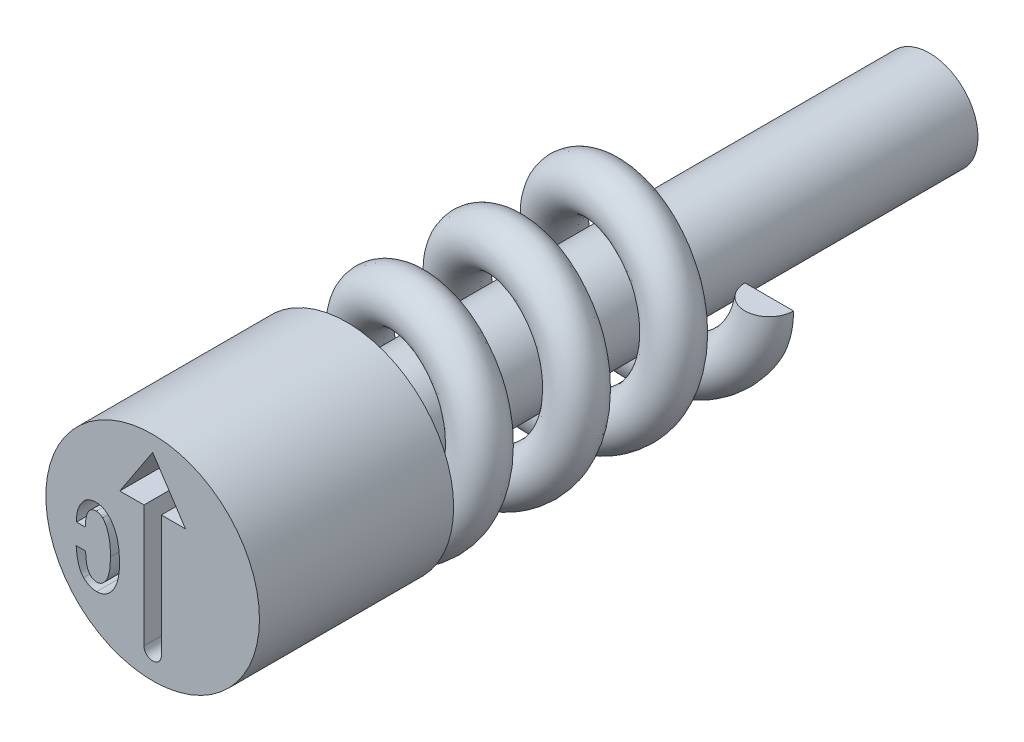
ISO-10303-21;
HEADER;
FILE_DESCRIPTION(('STEP AP214'),'2;1');
FILE_NAME('part.step','',(''),(''),'','','');
FILE_SCHEMA(('AUTOMOTIVE_DESIGN { 1 0 10303 214 1 1 1 1 }'));
ENDSEC;
DATA;
#1=APPLICATION_CONTEXT('core data for automotive mechanical design processes');
#2=APPLICATION_PROTOCOL_DEFINITION('international standard','automotive_design',2000,#1);
#3=PRODUCT_CONTEXT('',#1,'mechanical');
#4=PRODUCT('Part','Part','',(#3));
#5=PRODUCT_RELATED_PRODUCT_CATEGORY('part','',(#4));
#6=PRODUCT_DEFINITION_FORMATION('','',#4);
#7=PRODUCT_DEFINITION_CONTEXT('part definition',#1,'design');
#8=PRODUCT_DEFINITION('design','',#6,#7);
#9=PRODUCT_DEFINITION_SHAPE('','',#8);
#10=(LENGTH_UNIT() NAMED_UNIT(*) SI_UNIT(.MILLI.,.METRE.));
#11=(NAMED_UNIT(*) PLANE_ANGLE_UNIT() SI_UNIT($,.RADIAN.));
#12=(NAMED_UNIT(*) SI_UNIT($,.STERADIAN.) SOLID_ANGLE_UNIT());
#13=UNCERTAINTY_MEASURE_WITH_UNIT(LENGTH_MEASURE(1.E-05),#10,'distance_accuracy_value','');
#14=(GEOMETRIC_REPRESENTATION_CONTEXT(3) GLOBAL_UNCERTAINTY_ASSIGNED_CONTEXT((#13)) GLOBAL_UNIT_ASSIGNED_CONTEXT((#10,
#11,#12)) REPRESENTATION_CONTEXT('',''));
#15=CARTESIAN_POINT('',(0.,0.,0.));
#16=DIRECTION('',(0.,0.,1.));
#17=DIRECTION('',(1.,0.,0.));
#18=AXIS2_PLACEMENT_3D('',#15,#16,#17);
#19=CARTESIAN_POINT('',(0.85,0.,-5.75));
#20=DIRECTION('',(0.,-1.,0.));
#21=DIRECTION('',(0.,0.,-1.));
#22=AXIS2_PLACEMENT_3D('',#19,#20,#21);
#23=PLANE('',#22);
#24=CARTESIAN_POINT('',(0.85,0.,-5.5));
#25=DIRECTION('',(0.,1.,0.));
#26=DIRECTION('',(0.,0.,1.));
#27=AXIS2_PLACEMENT_3D('',#24,#25,#26);
#28=CIRCLE('',#27,0.25);
#29=CARTESIAN_POINT('',(0.6,-3.81647975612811E-13,-5.5));
#30=VERTEX_POINT('',#29);
#31=CARTESIAN_POINT('',(1.1,0.,-5.5));
#32=VERTEX_POINT('',#31);
#33=EDGE_CURVE('E88',#30,#32,#28,.T.);
#34=ORIENTED_EDGE('',*,*,#33,.T.);
#35=DIRECTION('',(-1.,0.,0.));
#36=VECTOR('',#35,1.);
#37=CARTESIAN_POINT('',(0.85,0.,-5.5));
#38=LINE('',#37,#36);
#39=EDGE_CURVE('E75',#32,#30,#38,.T.);
#40=ORIENTED_EDGE('',*,*,#39,.T.);
#41=EDGE_LOOP('',(#34,#40));
#42=FACE_BOUND('',#41,.T.);
#43=ADVANCED_FACE('F49',(#42),#23,.F.);
#44=CARTESIAN_POINT('',(-0.85,0.,-2.25));
#45=DIRECTION('',(0.,1.,0.));
#46=DIRECTION('',(-1.,0.,0.));
#47=AXIS2_PLACEMENT_3D('',#44,#45,#46);
#48=PLANE('',#47);
#49=DIRECTION('',(-1.,0.,0.));
#50=VECTOR('',#49,1.);
#51=CARTESIAN_POINT('',(-0.85,0.,-2.));
#52=LINE('',#51,#50);
#53=CARTESIAN_POINT('',(-0.6,0.,-2.));
#54=VERTEX_POINT('',#53);
#55=CARTESIAN_POINT('',(-1.1,0.,-2.));
#56=VERTEX_POINT('',#55);
#57=EDGE_CURVE('E69',#54,#56,#52,.T.);
#58=ORIENTED_EDGE('',*,*,#57,.F.);
#59=CARTESIAN_POINT('',(-0.85,0.,-2.));
#60=DIRECTION('',(0.,1.,0.));
#61=DIRECTION('',(-1.,0.,0.));
#62=AXIS2_PLACEMENT_3D('',#59,#60,#61);
#63=CIRCLE('',#62,0.25);
#64=EDGE_CURVE('E85',#54,#56,#63,.T.);
#65=ORIENTED_EDGE('',*,*,#64,.T.);
#66=EDGE_LOOP('',(#58,#65));
#67=FACE_BOUND('',#66,.T.);
#68=ADVANCED_FACE('F51',(#67),#48,.T.);
#69=CARTESIAN_POINT('',(0.85,0.,-5.25));
#70=CARTESIAN_POINT('',(0.85,-0.352081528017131,-5.1875));
#71=CARTESIAN_POINT('',(0.601040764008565,-0.601040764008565,-5.125));
#72=CARTESIAN_POINT('',(0.352081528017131,-0.85,-5.0625));
#73=CARTESIAN_POINT('',(0.,-0.85,-5.));
#74=CARTESIAN_POINT('',(-0.352081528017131,-0.85,-4.9375));
#75=CARTESIAN_POINT('',(-0.601040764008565,-0.601040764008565,-4.875));
#76=CARTESIAN_POINT('',(-0.85,-0.352081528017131,-4.8125));
#77=CARTESIAN_POINT('',(-0.85,0.,-4.75));
#78=CARTESIAN_POINT('',(-0.85,0.352081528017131,-4.6875));
#79=CARTESIAN_POINT('',(-0.601040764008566,0.601040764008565,-4.625));
#80=CARTESIAN_POINT('',(-0.352081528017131,0.85,-4.5625));
#81=CARTESIAN_POINT('',(0.,0.85,-4.5));
#82=CARTESIAN_POINT('',(0.352081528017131,0.85,-4.4375));
#83=CARTESIAN_POINT('',(0.601040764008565,0.601040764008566,-4.375));
#84=CARTESIAN_POINT('',(0.85,0.352081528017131,-4.3125));
#85=CARTESIAN_POINT('',(0.85,0.,-4.25));
#86=CARTESIAN_POINT('',(0.85,-0.352081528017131,-4.1875));
#87=CARTESIAN_POINT('',(0.601040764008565,-0.601040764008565,-4.125));
#88=CARTESIAN_POINT('',(0.352081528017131,-0.85,-4.0625));
#89=CARTESIAN_POINT('',(0.,-0.85,-4.));
#90=CARTESIAN_POINT('',(-0.352081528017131,-0.85,-3.9375));
#91=CARTESIAN_POINT('',(-0.601040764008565,-0.601040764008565,-3.875));
#92=CARTESIAN_POINT('',(-0.85,-0.352081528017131,-3.8125));
#93=CARTESIAN_POINT('',(-0.85,0.,-3.75));
#94=CARTESIAN_POINT('',(-0.85,0.352081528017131,-3.6875));
#95=CARTESIAN_POINT('',(-0.601040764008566,0.601040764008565,-3.625));
#96=CARTESIAN_POINT('',(-0.352081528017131,0.85,-3.5625));
#97=CARTESIAN_POINT('',(0.,0.85,-3.5));
#98=CARTESIAN_POINT('',(0.352081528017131,0.85,-3.4375));
#99=CARTESIAN_POINT('',(0.601040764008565,0.601040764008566,-3.375));
#100=CARTESIAN_POINT('',(0.85,0.352081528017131,-3.3125));
#101=CARTESIAN_POINT('',(0.85,0.,-3.25));
#102=CARTESIAN_POINT('',(0.85,-0.352081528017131,-3.1875));
#103=CARTESIAN_POINT('',(0.601040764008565,-0.601040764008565,-3.125));
#104=CARTESIAN_POINT('',(0.352081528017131,-0.85,-3.0625));
#105=CARTESIAN_POINT('',(0.,-0.85,-3.));
#106=CARTESIAN_POINT('',(-0.352081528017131,-0.85,-2.9375));
#107=CARTESIAN_POINT('',(-0.601040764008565,-0.601040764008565,-2.875));
#108=CARTESIAN_POINT('',(-0.85,-0.352081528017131,-2.8125));
#109=CARTESIAN_POINT('',(-0.85,0.,-2.75));
#110=CARTESIAN_POINT('',(-0.85,0.352081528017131,-2.6875));
#111=CARTESIAN_POINT('',(-0.601040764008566,0.601040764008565,-2.625));
#112=CARTESIAN_POINT('',(-0.352081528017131,0.85,-2.5625));
#113=CARTESIAN_POINT('',(0.,0.85,-2.5));
#114=CARTESIAN_POINT('',(0.352081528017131,0.85,-2.4375));
#115=CARTESIAN_POINT('',(0.601040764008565,0.601040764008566,-2.375));
#116=CARTESIAN_POINT('',(0.85,0.352081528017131,-2.3125));
#117=CARTESIAN_POINT('',(0.85,0.,-2.25));
#118=CARTESIAN_POINT('',(0.85,-0.352081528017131,-2.1875));
#119=CARTESIAN_POINT('',(0.601040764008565,-0.601040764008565,-2.125));
#120=CARTESIAN_POINT('',(0.352081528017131,-0.85,-2.0625));
#121=CARTESIAN_POINT('',(0.,-0.85,-2.));
#122=CARTESIAN_POINT('',(-0.352081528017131,-0.85,-1.9375));
#123=CARTESIAN_POINT('',(-0.601040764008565,-0.601040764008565,-1.875));
#124=CARTESIAN_POINT('',(-0.85,-0.352081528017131,-1.8125));
#125=CARTESIAN_POINT('',(-0.85,0.,-1.75));
#126=CARTESIAN_POINT('',(1.35,0.,-5.25));
#127=CARTESIAN_POINT('',(1.35,-0.559188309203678,-5.1875));
#128=CARTESIAN_POINT('',(0.954594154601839,-0.954594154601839,-5.125));
#129=CARTESIAN_POINT('',(0.559188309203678,-1.35,-5.0625));
#130=CARTESIAN_POINT('',(0.,-1.35,-5.));
#131=CARTESIAN_POINT('',(-0.559188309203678,-1.35,-4.9375));
#132=CARTESIAN_POINT('',(-0.954594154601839,-0.954594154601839,-4.875));
#133=CARTESIAN_POINT('',(-1.35,-0.559188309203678,-4.8125));
#134=CARTESIAN_POINT('',(-1.35,0.,-4.75));
#135=CARTESIAN_POINT('',(-1.35,0.559188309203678,-4.6875));
#136=CARTESIAN_POINT('',(-0.954594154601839,0.954594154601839,-4.625));
#137=CARTESIAN_POINT('',(-0.559188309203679,1.35,-4.5625));
#138=CARTESIAN_POINT('',(0.,1.35,-4.5));
#139=CARTESIAN_POINT('',(0.559188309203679,1.35,-4.4375));
#140=CARTESIAN_POINT('',(0.954594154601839,0.954594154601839,-4.375));
#141=CARTESIAN_POINT('',(1.35,0.559188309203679,-4.3125));
#142=CARTESIAN_POINT('',(1.35,0.,-4.25));
#143=CARTESIAN_POINT('',(1.35,-0.559188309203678,-4.1875));
#144=CARTESIAN_POINT('',(0.954594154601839,-0.954594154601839,-4.125));
#145=CARTESIAN_POINT('',(0.559188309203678,-1.35,-4.0625));
#146=CARTESIAN_POINT('',(0.,-1.35,-4.));
#147=CARTESIAN_POINT('',(-0.559188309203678,-1.35,-3.9375));
#148=CARTESIAN_POINT('',(-0.954594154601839,-0.954594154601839,-3.875));
#149=CARTESIAN_POINT('',(-1.35,-0.559188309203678,-3.8125));
#150=CARTESIAN_POINT('',(-1.35,0.,-3.75));
#151=CARTESIAN_POINT('',(-1.35,0.559188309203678,-3.6875));
#152=CARTESIAN_POINT('',(-0.954594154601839,0.954594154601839,-3.625));
#153=CARTESIAN_POINT('',(-0.559188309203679,1.35,-3.5625));
#154=CARTESIAN_POINT('',(0.,1.35,-3.5));
#155=CARTESIAN_POINT('',(0.559188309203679,1.35,-3.4375));
#156=CARTESIAN_POINT('',(0.954594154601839,0.954594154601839,-3.375));
#157=CARTESIAN_POINT('',(1.35,0.559188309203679,-3.3125));
#158=CARTESIAN_POINT('',(1.35,0.,-3.25));
#159=CARTESIAN_POINT('',(1.35,-0.559188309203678,-3.1875));
#160=CARTESIAN_POINT('',(0.954594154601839,-0.954594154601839,-3.125));
#161=CARTESIAN_POINT('',(0.559188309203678,-1.35,-3.0625));
#162=CARTESIAN_POINT('',(0.,-1.35,-3.));
#163=CARTESIAN_POINT('',(-0.559188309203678,-1.35,-2.9375));
#164=CARTESIAN_POINT('',(-0.954594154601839,-0.954594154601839,-2.875));
#165=CARTESIAN_POINT('',(-1.35,-0.559188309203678,-2.8125));
#166=CARTESIAN_POINT('',(-1.35,0.,-2.75));
#167=CARTESIAN_POINT('',(-1.35,0.559188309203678,-2.6875));
#168=CARTESIAN_POINT('',(-0.954594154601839,0.954594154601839,-2.625));
#169=CARTESIAN_POINT('',(-0.559188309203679,1.35,-2.5625));
#170=CARTESIAN_POINT('',(0.,1.35,-2.5));
#171=CARTESIAN_POINT('',(0.559188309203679,1.35,-2.4375));
#172=CARTESIAN_POINT('',(0.954594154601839,0.954594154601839,-2.375));
#173=CARTESIAN_POINT('',(1.35,0.559188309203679,-2.3125));
#174=CARTESIAN_POINT('',(1.35,0.,-2.25));
#175=CARTESIAN_POINT('',(1.35,-0.559188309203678,-2.1875));
#176=CARTESIAN_POINT('',(0.954594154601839,-0.954594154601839,-2.125));
#177=CARTESIAN_POINT('',(0.559188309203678,-1.35,-2.0625));
#178=CARTESIAN_POINT('',(0.,-1.35,-2.));
#179=CARTESIAN_POINT('',(-0.559188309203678,-1.35,-1.9375));
#180=CARTESIAN_POINT('',(-0.954594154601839,-0.954594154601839,-1.875));
#181=CARTESIAN_POINT('',(-1.35,-0.559188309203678,-1.8125));
#182=CARTESIAN_POINT('',(-1.35,0.,-1.75));
#183=CARTESIAN_POINT('',(1.35,0.,-5.75));
#184=CARTESIAN_POINT('',(1.35,-0.559188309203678,-5.6875));
#185=CARTESIAN_POINT('',(0.954594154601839,-0.954594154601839,-5.625));
#186=CARTESIAN_POINT('',(0.559188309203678,-1.35,-5.5625));
#187=CARTESIAN_POINT('',(0.,-1.35,-5.5));
#188=CARTESIAN_POINT('',(-0.559188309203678,-1.35,-5.4375));
#189=CARTESIAN_POINT('',(-0.954594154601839,-0.954594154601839,-5.375));
#190=CARTESIAN_POINT('',(-1.35,-0.559188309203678,-5.3125));
#191=CARTESIAN_POINT('',(-1.35,0.,-5.25));
#192=CARTESIAN_POINT('',(-1.35,0.559188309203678,-5.1875));
#193=CARTESIAN_POINT('',(-0.954594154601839,0.954594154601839,-5.125));
#194=CARTESIAN_POINT('',(-0.559188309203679,1.35,-5.0625));
#195=CARTESIAN_POINT('',(0.,1.35,-5.));
#196=CARTESIAN_POINT('',(0.559188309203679,1.35,-4.9375));
#197=CARTESIAN_POINT('',(0.954594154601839,0.954594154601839,-4.875));
#198=CARTESIAN_POINT('',(1.35,0.559188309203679,-4.8125));
#199=CARTESIAN_POINT('',(1.35,0.,-4.75));
#200=CARTESIAN_POINT('',(1.35,-0.559188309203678,-4.6875));
#201=CARTESIAN_POINT('',(0.954594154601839,-0.954594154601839,-4.625));
#202=CARTESIAN_POINT('',(0.559188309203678,-1.35,-4.5625));
#203=CARTESIAN_POINT('',(0.,-1.35,-4.5));
#204=CARTESIAN_POINT('',(-0.559188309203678,-1.35,-4.4375));
#205=CARTESIAN_POINT('',(-0.954594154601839,-0.954594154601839,-4.375));
#206=CARTESIAN_POINT('',(-1.35,-0.559188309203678,-4.3125));
#207=CARTESIAN_POINT('',(-1.35,0.,-4.25));
#208=CARTESIAN_POINT('',(-1.35,0.559188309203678,-4.1875));
#209=CARTESIAN_POINT('',(-0.954594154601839,0.954594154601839,-4.125));
#210=CARTESIAN_POINT('',(-0.559188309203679,1.35,-4.0625));
#211=CARTESIAN_POINT('',(0.,1.35,-4.));
#212=CARTESIAN_POINT('',(0.559188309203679,1.35,-3.9375));
#213=CARTESIAN_POINT('',(0.954594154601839,0.954594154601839,-3.875));
#214=CARTESIAN_POINT('',(1.35,0.559188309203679,-3.8125));
#215=CARTESIAN_POINT('',(1.35,0.,-3.75));
#216=CARTESIAN_POINT('',(1.35,-0.559188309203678,-3.6875));
#217=CARTESIAN_POINT('',(0.954594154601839,-0.954594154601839,-3.625));
#218=CARTESIAN_POINT('',(0.559188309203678,-1.35,-3.5625));
#219=CARTESIAN_POINT('',(0.,-1.35,-3.5));
#220=CARTESIAN_POINT('',(-0.559188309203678,-1.35,-3.4375));
#221=CARTESIAN_POINT('',(-0.954594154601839,-0.954594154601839,-3.375));
#222=CARTESIAN_POINT('',(-1.35,-0.559188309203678,-3.3125));
#223=CARTESIAN_POINT('',(-1.35,0.,-3.25));
#224=CARTESIAN_POINT('',(-1.35,0.559188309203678,-3.1875));
#225=CARTESIAN_POINT('',(-0.954594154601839,0.954594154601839,-3.125));
#226=CARTESIAN_POINT('',(-0.559188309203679,1.35,-3.0625));
#227=CARTESIAN_POINT('',(0.,1.35,-3.));
#228=CARTESIAN_POINT('',(0.559188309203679,1.35,-2.9375));
#229=CARTESIAN_POINT('',(0.954594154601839,0.954594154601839,-2.875));
#230=CARTESIAN_POINT('',(1.35,0.559188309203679,-2.8125));
#231=CARTESIAN_POINT('',(1.35,0.,-2.75));
#232=CARTESIAN_POINT('',(1.35,-0.559188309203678,-2.6875));
#233=CARTESIAN_POINT('',(0.954594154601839,-0.954594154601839,-2.625));
#234=CARTESIAN_POINT('',(0.559188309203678,-1.35,-2.5625));
#235=CARTESIAN_POINT('',(0.,-1.35,-2.5));
#236=CARTESIAN_POINT('',(-0.559188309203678,-1.35,-2.4375));
#237=CARTESIAN_POINT('',(-0.954594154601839,-0.954594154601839,-2.375));
#238=CARTESIAN_POINT('',(-1.35,-0.559188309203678,-2.3125));
#239=CARTESIAN_POINT('',(-1.35,0.,-2.25));
#240=CARTESIAN_POINT('',(0.85,0.,-5.75));
#241=CARTESIAN_POINT('',(0.85,-0.352081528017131,-5.6875));
#242=CARTESIAN_POINT('',(0.601040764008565,-0.601040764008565,-5.625));
#243=CARTESIAN_POINT('',(0.352081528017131,-0.85,-5.5625));
#244=CARTESIAN_POINT('',(0.,-0.85,-5.5));
#245=CARTESIAN_POINT('',(-0.352081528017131,-0.85,-5.4375));
#246=CARTESIAN_POINT('',(-0.601040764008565,-0.601040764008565,-5.375));
#247=CARTESIAN_POINT('',(-0.85,-0.352081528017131,-5.3125));
#248=CARTESIAN_POINT('',(-0.85,0.,-5.25));
#249=CARTESIAN_POINT('',(-0.85,0.352081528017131,-5.1875));
#250=CARTESIAN_POINT('',(-0.601040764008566,0.601040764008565,-5.125));
#251=CARTESIAN_POINT('',(-0.352081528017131,0.85,-5.0625));
#252=CARTESIAN_POINT('',(0.,0.85,-5.));
#253=CARTESIAN_POINT('',(0.352081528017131,0.85,-4.9375));
#254=CARTESIAN_POINT('',(0.601040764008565,0.601040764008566,-4.875));
#255=CARTESIAN_POINT('',(0.85,0.352081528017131,-4.8125));
#256=CARTESIAN_POINT('',(0.85,0.,-4.75));
#257=CARTESIAN_POINT('',(0.85,-0.352081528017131,-4.6875));
#258=CARTESIAN_POINT('',(0.601040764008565,-0.601040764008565,-4.625));
#259=CARTESIAN_POINT('',(0.352081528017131,-0.85,-4.5625));
#260=CARTESIAN_POINT('',(0.,-0.85,-4.5));
#261=CARTESIAN_POINT('',(-0.352081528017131,-0.85,-4.4375));
#262=CARTESIAN_POINT('',(-0.601040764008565,-0.601040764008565,-4.375));
#263=CARTESIAN_POINT('',(-0.85,-0.352081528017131,-4.3125));
#264=CARTESIAN_POINT('',(-0.85,0.,-4.25));
#265=CARTESIAN_POINT('',(-0.85,0.352081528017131,-4.1875));
#266=CARTESIAN_POINT('',(-0.601040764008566,0.601040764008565,-4.125));
#267=CARTESIAN_POINT('',(-0.352081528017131,0.85,-4.0625));
#268=CARTESIAN_POINT('',(0.,0.85,-4.));
#269=CARTESIAN_POINT('',(0.352081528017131,0.85,-3.9375));
#270=CARTESIAN_POINT('',(0.601040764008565,0.601040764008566,-3.875));
#271=CARTESIAN_POINT('',(0.85,0.352081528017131,-3.8125));
#272=CARTESIAN_POINT('',(0.85,0.,-3.75));
#273=CARTESIAN_POINT('',(0.85,-0.352081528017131,-3.6875));
#274=CARTESIAN_POINT('',(0.601040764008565,-0.601040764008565,-3.625));
#275=CARTESIAN_POINT('',(0.352081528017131,-0.85,-3.5625));
#276=CARTESIAN_POINT('',(0.,-0.85,-3.5));
#277=CARTESIAN_POINT('',(-0.352081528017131,-0.85,-3.4375));
#278=CARTESIAN_POINT('',(-0.601040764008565,-0.601040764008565,-3.375));
#279=CARTESIAN_POINT('',(-0.85,-0.352081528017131,-3.3125));
#280=CARTESIAN_POINT('',(-0.85,0.,-3.25));
#281=CARTESIAN_POINT('',(-0.85,0.352081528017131,-3.1875));
#282=CARTESIAN_POINT('',(-0.601040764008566,0.601040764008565,-3.125));
#283=CARTESIAN_POINT('',(-0.352081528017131,0.85,-3.0625));
#284=CARTESIAN_POINT('',(0.,0.85,-3.));
#285=CARTESIAN_POINT('',(0.352081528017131,0.85,-2.9375));
#286=CARTESIAN_POINT('',(0.601040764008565,0.601040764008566,-2.875));
#287=CARTESIAN_POINT('',(0.85,0.352081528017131,-2.8125));
#288=CARTESIAN_POINT('',(0.85,0.,-2.75));
#289=CARTESIAN_POINT('',(0.85,-0.352081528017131,-2.6875));
#290=CARTESIAN_POINT('',(0.601040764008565,-0.601040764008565,-2.625));
#291=CARTESIAN_POINT('',(0.352081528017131,-0.85,-2.5625));
#292=CARTESIAN_POINT('',(0.,-0.85,-2.5));
#293=CARTESIAN_POINT('',(-0.352081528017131,-0.85,-2.4375));
#294=CARTESIAN_POINT('',(-0.601040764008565,-0.601040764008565,-2.375));
#295=CARTESIAN_POINT('',(-0.85,-0.352081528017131,-2.3125));
#296=CARTESIAN_POINT('',(-0.85,0.,-2.25));
#297=CARTESIAN_POINT('',(0.35,0.,-5.75));
#298=CARTESIAN_POINT('',(0.35,-0.144974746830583,-5.6875));
#299=CARTESIAN_POINT('',(0.247487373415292,-0.247487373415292,-5.625));
#300=CARTESIAN_POINT('',(0.144974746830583,-0.35,-5.5625));
#301=CARTESIAN_POINT('',(0.,-0.35,-5.5));
#302=CARTESIAN_POINT('',(-0.144974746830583,-0.35,-5.4375));
#303=CARTESIAN_POINT('',(-0.247487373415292,-0.247487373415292,-5.375));
#304=CARTESIAN_POINT('',(-0.35,-0.144974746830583,-5.3125));
#305=CARTESIAN_POINT('',(-0.35,0.,-5.25));
#306=CARTESIAN_POINT('',(-0.35,0.144974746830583,-5.1875));
#307=CARTESIAN_POINT('',(-0.247487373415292,0.247487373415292,-5.125));
#308=CARTESIAN_POINT('',(-0.144974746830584,0.35,-5.0625));
#309=CARTESIAN_POINT('',(0.,0.35,-5.));
#310=CARTESIAN_POINT('',(0.144974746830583,0.35,-4.9375));
#311=CARTESIAN_POINT('',(0.247487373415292,0.247487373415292,-4.875));
#312=CARTESIAN_POINT('',(0.35,0.144974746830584,-4.8125));
#313=CARTESIAN_POINT('',(0.35,0.,-4.75));
#314=CARTESIAN_POINT('',(0.35,-0.144974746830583,-4.6875));
#315=CARTESIAN_POINT('',(0.247487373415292,-0.247487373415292,-4.625));
#316=CARTESIAN_POINT('',(0.144974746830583,-0.35,-4.5625));
#317=CARTESIAN_POINT('',(0.,-0.35,-4.5));
#318=CARTESIAN_POINT('',(-0.144974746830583,-0.35,-4.4375));
#319=CARTESIAN_POINT('',(-0.247487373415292,-0.247487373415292,-4.375));
#320=CARTESIAN_POINT('',(-0.35,-0.144974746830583,-4.3125));
#321=CARTESIAN_POINT('',(-0.35,0.,-4.25));
#322=CARTESIAN_POINT('',(-0.35,0.144974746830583,-4.1875));
#323=CARTESIAN_POINT('',(-0.247487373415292,0.247487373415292,-4.125));
#324=CARTESIAN_POINT('',(-0.144974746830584,0.35,-4.0625));
#325=CARTESIAN_POINT('',(0.,0.35,-4.));
#326=CARTESIAN_POINT('',(0.144974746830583,0.35,-3.9375));
#327=CARTESIAN_POINT('',(0.247487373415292,0.247487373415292,-3.875));
#328=CARTESIAN_POINT('',(0.35,0.144974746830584,-3.8125));
#329=CARTESIAN_POINT('',(0.35,0.,-3.75));
#330=CARTESIAN_POINT('',(0.35,-0.144974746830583,-3.6875));
#331=CARTESIAN_POINT('',(0.247487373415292,-0.247487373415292,-3.625));
#332=CARTESIAN_POINT('',(0.144974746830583,-0.35,-3.5625));
#333=CARTESIAN_POINT('',(0.,-0.35,-3.5));
#334=CARTESIAN_POINT('',(-0.144974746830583,-0.35,-3.4375));
#335=CARTESIAN_POINT('',(-0.247487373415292,-0.247487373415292,-3.375));
#336=CARTESIAN_POINT('',(-0.35,-0.144974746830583,-3.3125));
#337=CARTESIAN_POINT('',(-0.35,0.,-3.25));
#338=CARTESIAN_POINT('',(-0.35,0.144974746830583,-3.1875));
#339=CARTESIAN_POINT('',(-0.247487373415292,0.247487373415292,-3.125));
#340=CARTESIAN_POINT('',(-0.144974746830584,0.35,-3.0625));
#341=CARTESIAN_POINT('',(0.,0.35,-3.));
#342=CARTESIAN_POINT('',(0.144974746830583,0.35,-2.9375));
#343=CARTESIAN_POINT('',(0.247487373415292,0.247487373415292,-2.875));
#344=CARTESIAN_POINT('',(0.35,0.144974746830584,-2.8125));
#345=CARTESIAN_POINT('',(0.35,0.,-2.75));
#346=CARTESIAN_POINT('',(0.35,-0.144974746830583,-2.6875));
#347=CARTESIAN_POINT('',(0.247487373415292,-0.247487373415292,-2.625));
#348=CARTESIAN_POINT('',(0.144974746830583,-0.35,-2.5625));
#349=CARTESIAN_POINT('',(0.,-0.35,-2.5));
#350=CARTESIAN_POINT('',(-0.144974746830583,-0.35,-2.4375));
#351=CARTESIAN_POINT('',(-0.247487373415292,-0.247487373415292,-2.375));
#352=CARTESIAN_POINT('',(-0.35,-0.144974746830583,-2.3125));
#353=CARTESIAN_POINT('',(-0.35,0.,-2.25));
#354=CARTESIAN_POINT('',(0.35,0.,-5.25));
#355=CARTESIAN_POINT('',(0.35,-0.144974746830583,-5.1875));
#356=CARTESIAN_POINT('',(0.247487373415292,-0.247487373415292,-5.125));
#357=CARTESIAN_POINT('',(0.144974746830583,-0.35,-5.0625));
#358=CARTESIAN_POINT('',(0.,-0.35,-5.));
#359=CARTESIAN_POINT('',(-0.144974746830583,-0.35,-4.9375));
#360=CARTESIAN_POINT('',(-0.247487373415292,-0.247487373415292,-4.875));
#361=CARTESIAN_POINT('',(-0.35,-0.144974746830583,-4.8125));
#362=CARTESIAN_POINT('',(-0.35,0.,-4.75));
#363=CARTESIAN_POINT('',(-0.35,0.144974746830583,-4.6875));
#364=CARTESIAN_POINT('',(-0.247487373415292,0.247487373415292,-4.625));
#365=CARTESIAN_POINT('',(-0.144974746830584,0.35,-4.5625));
#366=CARTESIAN_POINT('',(0.,0.35,-4.5));
#367=CARTESIAN_POINT('',(0.144974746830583,0.35,-4.4375));
#368=CARTESIAN_POINT('',(0.247487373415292,0.247487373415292,-4.375));
#369=CARTESIAN_POINT('',(0.35,0.144974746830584,-4.3125));
#370=CARTESIAN_POINT('',(0.35,0.,-4.25));
#371=CARTESIAN_POINT('',(0.35,-0.144974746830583,-4.1875));
#372=CARTESIAN_POINT('',(0.247487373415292,-0.247487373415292,-4.125));
#373=CARTESIAN_POINT('',(0.144974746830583,-0.35,-4.0625));
#374=CARTESIAN_POINT('',(0.,-0.35,-4.));
#375=CARTESIAN_POINT('',(-0.144974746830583,-0.35,-3.9375));
#376=CARTESIAN_POINT('',(-0.247487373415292,-0.247487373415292,-3.875));
#377=CARTESIAN_POINT('',(-0.35,-0.144974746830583,-3.8125));
#378=CARTESIAN_POINT('',(-0.35,0.,-3.75));
#379=CARTESIAN_POINT('',(-0.35,0.144974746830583,-3.6875));
#380=CARTESIAN_POINT('',(-0.247487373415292,0.247487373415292,-3.625));
#381=CARTESIAN_POINT('',(-0.144974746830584,0.35,-3.5625));
#382=CARTESIAN_POINT('',(0.,0.35,-3.5));
#383=CARTESIAN_POINT('',(0.144974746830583,0.35,-3.4375));
#384=CARTESIAN_POINT('',(0.247487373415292,0.247487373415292,-3.375));
#385=CARTESIAN_POINT('',(0.35,0.144974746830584,-3.3125));
#386=CARTESIAN_POINT('',(0.35,0.,-3.25));
#387=CARTESIAN_POINT('',(0.35,-0.144974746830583,-3.1875));
#388=CARTESIAN_POINT('',(0.247487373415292,-0.247487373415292,-3.125));
#389=CARTESIAN_POINT('',(0.144974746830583,-0.35,-3.0625));
#390=CARTESIAN_POINT('',(0.,-0.35,-3.));
#391=CARTESIAN_POINT('',(-0.144974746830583,-0.35,-2.9375));
#392=CARTESIAN_POINT('',(-0.247487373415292,-0.247487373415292,-2.875));
#393=CARTESIAN_POINT('',(-0.35,-0.144974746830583,-2.8125));
#394=CARTESIAN_POINT('',(-0.35,0.,-2.75));
#395=CARTESIAN_POINT('',(-0.35,0.144974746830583,-2.6875));
#396=CARTESIAN_POINT('',(-0.247487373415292,0.247487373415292,-2.625));
#397=CARTESIAN_POINT('',(-0.144974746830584,0.35,-2.5625));
#398=CARTESIAN_POINT('',(0.,0.35,-2.5));
#399=CARTESIAN_POINT('',(0.144974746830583,0.35,-2.4375));
#400=CARTESIAN_POINT('',(0.247487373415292,0.247487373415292,-2.375));
#401=CARTESIAN_POINT('',(0.35,0.144974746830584,-2.3125));
#402=CARTESIAN_POINT('',(0.35,0.,-2.25));
#403=CARTESIAN_POINT('',(0.35,-0.144974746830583,-2.1875));
#404=CARTESIAN_POINT('',(0.247487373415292,-0.247487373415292,-2.125));
#405=CARTESIAN_POINT('',(0.144974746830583,-0.35,-2.0625));
#406=CARTESIAN_POINT('',(0.,-0.35,-2.));
#407=CARTESIAN_POINT('',(-0.144974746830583,-0.35,-1.9375));
#408=CARTESIAN_POINT('',(-0.247487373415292,-0.247487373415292,-1.875));
#409=CARTESIAN_POINT('',(-0.35,-0.144974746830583,-1.8125));
#410=CARTESIAN_POINT('',(-0.35,0.,-1.75));
#411=CARTESIAN_POINT('',(0.85,0.,-5.25));
#412=CARTESIAN_POINT('',(0.85,-0.352081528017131,-5.1875));
#413=CARTESIAN_POINT('',(0.601040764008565,-0.601040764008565,-5.125));
#414=CARTESIAN_POINT('',(0.352081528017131,-0.85,-5.0625));
#415=CARTESIAN_POINT('',(0.,-0.85,-5.));
#416=CARTESIAN_POINT('',(-0.352081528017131,-0.85,-4.9375));
#417=CARTESIAN_POINT('',(-0.601040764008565,-0.601040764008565,-4.875));
#418=CARTESIAN_POINT('',(-0.85,-0.352081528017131,-4.8125));
#419=CARTESIAN_POINT('',(-0.85,0.,-4.75));
#420=CARTESIAN_POINT('',(-0.85,0.352081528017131,-4.6875));
#421=CARTESIAN_POINT('',(-0.601040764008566,0.601040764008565,-4.625));
#422=CARTESIAN_POINT('',(-0.352081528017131,0.85,-4.5625));
#423=CARTESIAN_POINT('',(0.,0.85,-4.5));
#424=CARTESIAN_POINT('',(0.352081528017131,0.85,-4.4375));
#425=CARTESIAN_POINT('',(0.601040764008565,0.601040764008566,-4.375));
#426=CARTESIAN_POINT('',(0.85,0.352081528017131,-4.3125));
#427=CARTESIAN_POINT('',(0.85,0.,-4.25));
#428=CARTESIAN_POINT('',(0.85,-0.352081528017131,-4.1875));
#429=CARTESIAN_POINT('',(0.601040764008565,-0.601040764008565,-4.125));
#430=CARTESIAN_POINT('',(0.352081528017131,-0.85,-4.0625));
#431=CARTESIAN_POINT('',(0.,-0.85,-4.));
#432=CARTESIAN_POINT('',(-0.352081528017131,-0.85,-3.9375));
#433=CARTESIAN_POINT('',(-0.601040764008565,-0.601040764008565,-3.875));
#434=CARTESIAN_POINT('',(-0.85,-0.352081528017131,-3.8125));
#435=CARTESIAN_POINT('',(-0.85,0.,-3.75));
#436=CARTESIAN_POINT('',(-0.85,0.352081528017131,-3.6875));
#437=CARTESIAN_POINT('',(-0.601040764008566,0.601040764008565,-3.625));
#438=CARTESIAN_POINT('',(-0.352081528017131,0.85,-3.5625));
#439=CARTESIAN_POINT('',(0.,0.85,-3.5));
#440=CARTESIAN_POINT('',(0.352081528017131,0.85,-3.4375));
#441=CARTESIAN_POINT('',(0.601040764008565,0.601040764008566,-3.375));
#442=CARTESIAN_POINT('',(0.85,0.352081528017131,-3.3125));
#443=CARTESIAN_POINT('',(0.85,0.,-3.25));
#444=CARTESIAN_POINT('',(0.85,-0.352081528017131,-3.1875));
#445=CARTESIAN_POINT('',(0.601040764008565,-0.601040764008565,-3.125));
#446=CARTESIAN_POINT('',(0.352081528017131,-0.85,-3.0625));
#447=CARTESIAN_POINT('',(0.,-0.85,-3.));
#448=CARTESIAN_POINT('',(-0.352081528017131,-0.85,-2.9375));
#449=CARTESIAN_POINT('',(-0.601040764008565,-0.601040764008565,-2.875));
#450=CARTESIAN_POINT('',(-0.85,-0.352081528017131,-2.8125));
#451=CARTESIAN_POINT('',(-0.85,0.,-2.75));
#452=CARTESIAN_POINT('',(-0.85,0.352081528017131,-2.6875));
#453=CARTESIAN_POINT('',(-0.601040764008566,0.601040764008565,-2.625));
#454=CARTESIAN_POINT('',(-0.352081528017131,0.85,-2.5625));
#455=CARTESIAN_POINT('',(0.,0.85,-2.5));
#456=CARTESIAN_POINT('',(0.352081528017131,0.85,-2.4375));
#457=CARTESIAN_POINT('',(0.601040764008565,0.601040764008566,-2.375));
#458=CARTESIAN_POINT('',(0.85,0.352081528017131,-2.3125));
#459=CARTESIAN_POINT('',(0.85,0.,-2.25));
#460=CARTESIAN_POINT('',(0.85,-0.352081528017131,-2.1875));
#461=CARTESIAN_POINT('',(0.601040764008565,-0.601040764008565,-2.125));
#462=CARTESIAN_POINT('',(0.352081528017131,-0.85,-2.0625));
#463=CARTESIAN_POINT('',(0.,-0.85,-2.));
#464=CARTESIAN_POINT('',(-0.352081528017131,-0.85,-1.9375));
#465=CARTESIAN_POINT('',(-0.601040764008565,-0.601040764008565,-1.875));
#466=CARTESIAN_POINT('',(-0.85,-0.352081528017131,-1.8125));
#467=CARTESIAN_POINT('',(-0.85,0.,-1.75));
#468=(BOUNDED_SURFACE() B_SPLINE_SURFACE(3,2,((#69,#70,#71,#72,#73,#74,#75,#76,#77,#78,#79,#80,
#81,#82,#83,#84,#85,#86,#87,#88,#89,#90,#91,#92,#93,#94,#95,#96,#97,#98,#99,#100,#101,#102,#103,
#104,#105,#106,#107,#108,#109,#110,#111,#112,#113,#114,#115,#116,#117,#118,#119,#120,#121,#122,
#123,#124,#125),(#126,#127,#128,#129,#130,#131,#132,#133,#134,#135,#136,#137,#138,#139,#140,
#141,#142,#143,#144,#145,#146,#147,#148,#149,#150,#151,#152,#153,#154,#155,#156,#157,#158,#159,
#160,#161,#162,#163,#164,#165,#166,#167,#168,#169,#170,#171,#172,#173,#174,#175,#176,#177,#178,
#179,#180,#181,#182),(#183,#184,#185,#186,#187,#188,#189,#190,#191,#192,#193,#194,#195,#196,
#197,#198,#199,#200,#201,#202,#203,#204,#205,#206,#207,#208,#209,#210,#211,#212,#213,#214,#215,
#216,#217,#218,#219,#220,#221,#222,#223,#224,#225,#226,#227,#228,#229,#230,#231,#232,#233,#234,
#235,#236,#237,#238,#239),(#240,#241,#242,#243,#244,#245,#246,#247,#248,#249,#250,#251,#252,
#253,#254,#255,#256,#257,#258,#259,#260,#261,#262,#263,#264,#265,#266,#267,#268,#269,#270,#271,
#272,#273,#274,#275,#276,#277,#278,#279,#280,#281,#282,#283,#284,#285,#286,#287,#288,#289,#290,
#291,#292,#293,#294,#295,#296),(#297,#298,#299,#300,#301,#302,#303,#304,#305,#306,#307,#308,
#309,#310,#311,#312,#313,#314,#315,#316,#317,#318,#319,#320,#321,#322,#323,#324,#325,#326,#327,
#328,#329,#330,#331,#332,#333,#334,#335,#336,#337,#338,#339,#340,#341,#342,#343,#344,#345,#346,
#347,#348,#349,#350,#351,#352,#353),(#354,#355,#356,#357,#358,#359,#360,#361,#362,#363,#364,
#365,#366,#367,#368,#369,#370,#371,#372,#373,#374,#375,#376,#377,#378,#379,#380,#381,#382,#383,
#384,#385,#386,#387,#388,#389,#390,#391,#392,#393,#394,#395,#396,#397,#398,#399,#400,#401,#402,
#403,#404,#405,#406,#407,#408,#409,#410),(#411,#412,#413,#414,#415,#416,#417,#418,#419,#420,
#421,#422,#423,#424,#425,#426,#427,#428,#429,#430,#431,#432,#433,#434,#435,#436,#437,#438,#439,
#440,#441,#442,#443,#444,#445,#446,#447,#448,#449,#450,#451,#452,#453,#454,#455,#456,#457,#458,
#459,#460,#461,#462,#463,#464,#465,#466,#467)),.UNSPECIFIED.,.T.,.F.,
.F.) B_SPLINE_SURFACE_WITH_KNOTS((4,3,4),(3,2,2,2,2,2,2,2,2,2,2,2,2,2,2,2,2,2,2,2,2,2,2,2,2,2,2,
2,3),(0.,0.5,1.),(0.,0.03125,0.0625,0.09375,0.125,0.15625,0.1875,0.21875,0.25,0.28125,0.3125,
0.34375,0.375,0.40625,0.4375,0.46875,0.5,0.53125,0.5625,0.59375,0.625,0.65625,0.6875,0.71875,
0.75,0.78125,0.8125,0.84375,0.875),
.UNSPECIFIED.) GEOMETRIC_REPRESENTATION_ITEM() RATIONAL_B_SPLINE_SURFACE(((1.,0.923879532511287,
1.,0.923879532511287,1.,0.923879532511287,1.,0.923879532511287,1.,0.923879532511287,1.,
0.923879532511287,1.,0.923879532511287,1.,0.923879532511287,1.,0.923879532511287,1.,
0.923879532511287,1.,0.923879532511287,1.,0.923879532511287,1.,0.923879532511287,1.,
0.923879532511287,1.,0.923879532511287,1.,0.923879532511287,1.,0.923879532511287,1.,
0.923879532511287,1.,0.923879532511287,1.,0.923879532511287,1.,0.923879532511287,1.,
0.923879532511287,1.,0.923879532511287,1.,0.923879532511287,1.,0.923879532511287,1.,
0.923879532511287,1.,0.923879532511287,1.,0.923879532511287,1.),(0.333333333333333,
0.307959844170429,0.333333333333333,0.307959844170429,0.333333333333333,0.307959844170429,
0.333333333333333,0.307959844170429,0.333333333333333,0.307959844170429,0.333333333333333,
0.307959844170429,0.333333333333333,0.307959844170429,0.333333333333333,0.307959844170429,
0.333333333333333,0.307959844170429,0.333333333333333,0.307959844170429,0.333333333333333,
0.307959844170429,0.333333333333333,0.307959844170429,0.333333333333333,0.307959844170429,
0.333333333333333,0.307959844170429,0.333333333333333,0.307959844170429,0.333333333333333,
0.307959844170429,0.333333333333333,0.307959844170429,0.333333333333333,0.307959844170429,
0.333333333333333,0.307959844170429,0.333333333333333,0.307959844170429,0.333333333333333,
0.307959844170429,0.333333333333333,0.307959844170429,0.333333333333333,0.307959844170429,
0.333333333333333,0.307959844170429,0.333333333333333,0.307959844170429,0.333333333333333,
0.307959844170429,0.333333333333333,0.307959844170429,0.333333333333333,0.307959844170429,
0.333333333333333),(0.333333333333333,0.307959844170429,0.333333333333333,0.307959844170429,
0.333333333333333,0.307959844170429,0.333333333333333,0.307959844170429,0.333333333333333,
0.307959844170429,0.333333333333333,0.307959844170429,0.333333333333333,0.307959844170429,
0.333333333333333,0.307959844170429,0.333333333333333,0.307959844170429,0.333333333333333,
0.307959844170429,0.333333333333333,0.307959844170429,0.333333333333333,0.307959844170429,
0.333333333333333,0.307959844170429,0.333333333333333,0.307959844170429,0.333333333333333,
0.307959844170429,0.333333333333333,0.307959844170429,0.333333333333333,0.307959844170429,
0.333333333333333,0.307959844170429,0.333333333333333,0.307959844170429,0.333333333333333,
0.307959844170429,0.333333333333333,0.307959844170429,0.333333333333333,0.307959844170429,
0.333333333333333,0.307959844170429,0.333333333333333,0.307959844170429,0.333333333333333,
0.307959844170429,0.333333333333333,0.307959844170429,0.333333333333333,0.307959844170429,
0.333333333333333,0.307959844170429,0.333333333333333),(1.,0.923879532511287,1.,
0.923879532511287,1.,0.923879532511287,1.,0.923879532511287,1.,0.923879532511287,1.,
0.923879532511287,1.,0.923879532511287,1.,0.923879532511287,1.,0.923879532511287,1.,
0.923879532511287,1.,0.923879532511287,1.,0.923879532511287,1.,0.923879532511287,1.,
0.923879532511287,1.,0.923879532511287,1.,0.923879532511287,1.,0.923879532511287,1.,
0.923879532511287,1.,0.923879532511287,1.,0.923879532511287,1.,0.923879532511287,1.,
0.923879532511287,1.,0.923879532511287,1.,0.923879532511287,1.,0.923879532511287,1.,
0.923879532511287,1.,0.923879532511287,1.,0.923879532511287,1.),(0.333333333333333,
0.307959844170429,0.333333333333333,0.307959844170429,0.333333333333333,0.307959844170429,
0.333333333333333,0.307959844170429,0.333333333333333,0.307959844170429,0.333333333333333,
0.307959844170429,0.333333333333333,0.307959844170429,0.333333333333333,0.307959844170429,
0.333333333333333,0.307959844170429,0.333333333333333,0.307959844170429,0.333333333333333,
0.307959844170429,0.333333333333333,0.307959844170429,0.333333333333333,0.307959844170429,
0.333333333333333,0.307959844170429,0.333333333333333,0.307959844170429,0.333333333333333,
0.307959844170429,0.333333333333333,0.307959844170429,0.333333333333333,0.307959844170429,
0.333333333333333,0.307959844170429,0.333333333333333,0.307959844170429,0.333333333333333,
0.307959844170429,0.333333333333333,0.307959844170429,0.333333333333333,0.307959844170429,
0.333333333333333,0.307959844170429,0.333333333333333,0.307959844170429,0.333333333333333,
0.307959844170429,0.333333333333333,0.307959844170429,0.333333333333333,0.307959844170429,
0.333333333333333),(0.333333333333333,0.307959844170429,0.333333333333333,0.307959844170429,
0.333333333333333,0.307959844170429,0.333333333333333,0.307959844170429,0.333333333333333,
0.307959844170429,0.333333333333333,0.307959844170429,0.333333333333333,0.307959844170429,
0.333333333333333,0.307959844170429,0.333333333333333,0.307959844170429,0.333333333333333,
0.307959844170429,0.333333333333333,0.307959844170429,0.333333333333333,0.307959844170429,
0.333333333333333,0.307959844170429,0.333333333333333,0.307959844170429,0.333333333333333,
0.307959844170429,0.333333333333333,0.307959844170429,0.333333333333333,0.307959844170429,
0.333333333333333,0.307959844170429,0.333333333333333,0.307959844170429,0.333333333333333,
0.307959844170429,0.333333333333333,0.307959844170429,0.333333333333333,0.307959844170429,
0.333333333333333,0.307959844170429,0.333333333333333,0.307959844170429,0.333333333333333,
0.307959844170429,0.333333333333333,0.307959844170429,0.333333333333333,0.307959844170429,
0.333333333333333,0.307959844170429,0.333333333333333),(1.,0.923879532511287,1.,
0.923879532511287,1.,0.923879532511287,1.,0.923879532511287,1.,0.923879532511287,1.,
0.923879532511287,1.,0.923879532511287,1.,0.923879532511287,1.,0.923879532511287,1.,
0.923879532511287,1.,0.923879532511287,1.,0.923879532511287,1.,0.923879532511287,1.,
0.923879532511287,1.,0.923879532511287,1.,0.923879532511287,1.,0.923879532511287,1.,
0.923879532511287,1.,0.923879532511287,1.,0.923879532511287,1.,0.923879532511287,1.,
0.923879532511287,1.,0.923879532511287,1.,0.923879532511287,1.,0.923879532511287,1.,
0.923879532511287,1.,0.923879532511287,1.,0.923879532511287,1.))) REPRESENTATION_ITEM('') SURFACE());
#469=CARTESIAN_POINT('',(0.6,-3.81647975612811E-13,-5.5));
#470=CARTESIAN_POINT('',(0.600016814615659,-0.0405965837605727,-5.5));
#471=CARTESIAN_POINT('',(0.596507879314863,-0.0811817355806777,-5.5));
#472=CARTESIAN_POINT('',(0.582872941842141,-0.161166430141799,-5.5));
#473=CARTESIAN_POINT('',(0.572757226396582,-0.200567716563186,-5.5));
#474=CARTESIAN_POINT('',(0.552836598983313,-0.25832158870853,-5.5));
#475=CARTESIAN_POINT('',(0.545325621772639,-0.27749581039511,-5.5));
#476=CARTESIAN_POINT('',(0.528761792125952,-0.315167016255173,-5.5));
#477=CARTESIAN_POINT('',(0.519709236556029,-0.333664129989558,-5.5));
#478=CARTESIAN_POINT('',(0.500125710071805,-0.369841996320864,-5.5));
#479=CARTESIAN_POINT('',(0.489595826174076,-0.38752333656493,-5.5));
#480=CARTESIAN_POINT('',(0.472745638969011,-0.413354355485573,-5.5));
#481=CARTESIAN_POINT('',(0.466951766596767,-0.421851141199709,-5.5));
#482=CARTESIAN_POINT('',(0.45500994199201,-0.438592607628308,-5.5));
#483=CARTESIAN_POINT('',(0.448861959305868,-0.446837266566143,-5.5));
#484=CARTESIAN_POINT('',(0.425480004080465,-0.47704101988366,-5.5));
#485=CARTESIAN_POINT('',(0.407308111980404,-0.498282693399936,-5.5));
#486=CARTESIAN_POINT('',(0.369142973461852,-0.539056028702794,-5.5));
#487=CARTESIAN_POINT('',(0.349149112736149,-0.558587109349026,-5.5));
#488=CARTESIAN_POINT('',(0.307612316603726,-0.596010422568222,-5.5));
#489=CARTESIAN_POINT('',(0.286066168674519,-0.613899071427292,-5.5));
#490=CARTESIAN_POINT('',(0.241814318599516,-0.648154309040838,-5.5));
#491=CARTESIAN_POINT('',(0.219108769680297,-0.664521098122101,-5.5));
#492=CARTESIAN_POINT('',(0.182629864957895,-0.689551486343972,-5.5));
#493=CARTESIAN_POINT('',(0.169096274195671,-0.698571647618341,-5.5));
#494=CARTESIAN_POINT('',(0.141920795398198,-0.716422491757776,-5.5));
#495=CARTESIAN_POINT('',(0.128278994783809,-0.725253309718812,-5.5));
#496=CARTESIAN_POINT('',(0.10104446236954,-0.74304224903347,-5.49999999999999));
#497=CARTESIAN_POINT('',(0.087451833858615,-0.752000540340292,-5.49999999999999));
#498=CARTESIAN_POINT('',(0.0674482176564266,-0.766017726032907,-5.5));
#499=CARTESIAN_POINT('',(0.0608397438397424,-0.770790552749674,-5.50000000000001));
#500=CARTESIAN_POINT('',(0.0478888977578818,-0.780680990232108,-5.49999999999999));
#501=CARTESIAN_POINT('',(0.0415462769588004,-0.785798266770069,-5.49999999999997));
#502=CARTESIAN_POINT('',(0.0305840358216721,-0.795559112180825,-5.50000000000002));
#503=CARTESIAN_POINT('',(0.0258718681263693,-0.80009595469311,-5.50000000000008));
#504=CARTESIAN_POINT('',(0.0170867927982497,-0.809725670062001,-5.49999999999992));
#505=CARTESIAN_POINT('',(0.0130104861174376,-0.814815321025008,-5.49999999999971));
#506=CARTESIAN_POINT('',(0.00636545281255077,-0.825397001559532,-5.49999999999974));
#507=CARTESIAN_POINT('',(0.00370009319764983,-0.830821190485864,-5.49999999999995));
#508=CARTESIAN_POINT('',(0.0011482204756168,-0.83944893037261,-5.50000000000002));
#509=CARTESIAN_POINT('',(0.000539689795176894,-0.842431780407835,-5.50000000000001));
#510=CARTESIAN_POINT('',(-7.45222064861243E-05,-0.848456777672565,-5.49999999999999));
#511=CARTESIAN_POINT('',(-8.12664442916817E-05,-0.85149881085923,-5.5));
#512=CARTESIAN_POINT('',(0.000769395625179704,-0.85971784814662,-5.50000000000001));
#513=CARTESIAN_POINT('',(0.00226053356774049,-0.864834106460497,-5.5));
#514=CARTESIAN_POINT('',(0.00746361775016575,-0.876236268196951,-5.5));
#515=CARTESIAN_POINT('',(0.0118136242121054,-0.882203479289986,-5.5));
#516=CARTESIAN_POINT('',(0.0211258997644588,-0.892265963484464,-5.50000000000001));
#517=CARTESIAN_POINT('',(0.0259557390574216,-0.896498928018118,-5.50000000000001));
#518=CARTESIAN_POINT('',(0.0361677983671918,-0.90425895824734,-5.49999999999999));
#519=CARTESIAN_POINT('',(0.0415515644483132,-0.907783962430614,-5.49999999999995));
#520=CARTESIAN_POINT('',(0.0587740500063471,-0.917866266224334,-5.50000000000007));
#521=CARTESIAN_POINT('',(0.0711637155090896,-0.923463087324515,-5.5000000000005));
#522=CARTESIAN_POINT('',(0.0965556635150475,-0.932973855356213,-5.4999999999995));
#523=CARTESIAN_POINT('',(0.109559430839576,-0.936883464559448,-5.49999999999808));
#524=CARTESIAN_POINT('',(0.149235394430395,-0.946687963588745,-5.49999999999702));
#525=CARTESIAN_POINT('',(0.17640581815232,-0.950580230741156,-5.50000000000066));
#526=CARTESIAN_POINT('',(0.230987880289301,-0.954406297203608,-5.49999999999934));
#527=CARTESIAN_POINT('',(0.258399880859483,-0.954332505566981,-5.49999999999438));
#528=CARTESIAN_POINT('',(0.326627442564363,-0.949917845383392,-5.49999999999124));
#529=CARTESIAN_POINT('',(0.367315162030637,-0.943468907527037,-5.49999999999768));
#530=CARTESIAN_POINT('',(0.447080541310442,-0.924138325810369,-5.50000000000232));
#531=CARTESIAN_POINT('',(0.486157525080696,-0.911254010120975,-5.50000000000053));
#532=CARTESIAN_POINT('',(0.562780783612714,-0.879491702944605,-5.49999999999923));
#533=CARTESIAN_POINT('',(0.600275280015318,-0.86048944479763,-5.49999999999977));
#534=CARTESIAN_POINT('',(0.672142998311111,-0.817287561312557,-5.50000000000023));
#535=CARTESIAN_POINT('',(0.706515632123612,-0.793086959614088,-5.50000000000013));
#536=CARTESIAN_POINT('',(0.757935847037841,-0.751324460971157,-5.49999999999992));
#537=CARTESIAN_POINT('',(0.776203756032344,-0.735234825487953,-5.49999999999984));
#538=CARTESIAN_POINT('',(0.811497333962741,-0.701744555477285,-5.50000000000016));
#539=CARTESIAN_POINT('',(0.828522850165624,-0.684343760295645,-5.50000000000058));
#540=CARTESIAN_POINT('',(0.877571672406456,-0.630281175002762,-5.49999999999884));
#541=CARTESIAN_POINT('',(0.907576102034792,-0.591751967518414,-5.49999999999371));
#542=CARTESIAN_POINT('',(0.964689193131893,-0.505886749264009,-5.49999999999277));
#543=CARTESIAN_POINT('',(0.991040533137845,-0.458047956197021,-5.49999999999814));
#544=CARTESIAN_POINT('',(1.03549605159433,-0.358672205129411,-5.50000000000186));
#545=CARTESIAN_POINT('',(1.05360009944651,-0.307135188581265,-5.50000000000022));
#546=CARTESIAN_POINT('',(1.07823351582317,-0.212973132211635,-5.49999999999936));
#547=CARTESIAN_POINT('',(1.0864006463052,-0.170767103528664,-5.4999999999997));
#548=CARTESIAN_POINT('',(1.0972875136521,-0.0857095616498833,-5.5000000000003));
#549=CARTESIAN_POINT('',(1.10001384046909,-0.042858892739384,-5.50000000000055));
#550=CARTESIAN_POINT('',(1.1,-6.9970479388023E-13,-5.5));
#551=B_SPLINE_CURVE_WITH_KNOTS('',3,(#469,#470,#471,#472,#473,#474,#475,#476,#477,#478,#479,
#480,#481,#482,#483,#484,#485,#486,#487,#488,#489,#490,#491,#492,#493,#494,#495,#496,#497,#498,
#499,#500,#501,#502,#503,#504,#505,#506,#507,#508,#509,#510,#511,#512,#513,#514,#515,#516,#517,
#518,#519,#520,#521,#522,#523,#524,#525,#526,#527,#528,#529,#530,#531,#532,#533,#534,#535,#536,
#537,#538,#539,#540,#541,#542,#543,#544,#545,#546,#547,#548,#549,#550),.UNSPECIFIED.,.F.,.F.,(4,
2,2,2,2,2,2,2,2,2,2,2,2,2,2,2,2,2,2,2,2,2,2,2,2,2,2,2,2,2,2,2,2,2,2,2,2,2,2,2,4),(0.,
0.121643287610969,0.243097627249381,0.304819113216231,0.366528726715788,0.428193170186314,
0.459037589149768,0.489884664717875,0.573609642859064,0.657362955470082,0.741294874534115,
0.825215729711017,0.874005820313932,0.922759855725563,0.971586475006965,0.996036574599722,
1.02046328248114,1.04005503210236,1.05953817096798,1.07741390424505,1.08649332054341,
1.09555669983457,1.11122916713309,1.13299536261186,1.15219828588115,1.171456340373,
1.2120230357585,1.25269341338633,1.33457516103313,1.41661363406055,1.53953398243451,
1.66250540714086,1.78815144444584,1.91382110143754,1.98678732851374,2.05976251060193,
2.20567896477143,2.36878193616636,2.53188749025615,2.66051486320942,2.78898634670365),.UNSPECIFIED.);
#552=EDGE_CURVE('E63',#30,#32,#551,.T.);
#553=CARTESIAN_POINT('',(-0.6,0.,-2.));
#554=CARTESIAN_POINT('',(-0.600016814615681,-0.0405965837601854,-2.));
#555=CARTESIAN_POINT('',(-0.596507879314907,-0.0811817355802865,-2.));
#556=CARTESIAN_POINT('',(-0.58287294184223,-0.161166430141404,-2.));
#557=CARTESIAN_POINT('',(-0.572757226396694,-0.200567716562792,-2.));
#558=CARTESIAN_POINT('',(-0.55283659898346,-0.25832158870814,-2.));
#559=CARTESIAN_POINT('',(-0.545325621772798,-0.277495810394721,-2.));
#560=CARTESIAN_POINT('',(-0.528761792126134,-0.315167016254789,-2.));
#561=CARTESIAN_POINT('',(-0.519709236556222,-0.333664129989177,-2.));
#562=CARTESIAN_POINT('',(-0.50012571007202,-0.36984199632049,-2.));
#563=CARTESIAN_POINT('',(-0.489595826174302,-0.387523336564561,-2.));
#564=CARTESIAN_POINT('',(-0.472745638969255,-0.413354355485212,-2.));
#565=CARTESIAN_POINT('',(-0.466951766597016,-0.42185114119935,-2.));
#566=CARTESIAN_POINT('',(-0.45500994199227,-0.438592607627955,-2.));
#567=CARTESIAN_POINT('',(-0.448861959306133,-0.446837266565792,-2.));
#568=CARTESIAN_POINT('',(-0.425480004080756,-0.477041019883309,-2.));
#569=CARTESIAN_POINT('',(-0.407308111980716,-0.498282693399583,-2.));
#570=CARTESIAN_POINT('',(-0.369142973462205,-0.539056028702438,-2.));
#571=CARTESIAN_POINT('',(-0.349149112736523,-0.55858710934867,-2.));
#572=CARTESIAN_POINT('',(-0.307612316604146,-0.596010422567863,-2.));
#573=CARTESIAN_POINT('',(-0.286066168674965,-0.61389907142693,-2.));
#574=CARTESIAN_POINT('',(-0.241814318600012,-0.648154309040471,-2.));
#575=CARTESIAN_POINT('',(-0.219108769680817,-0.664521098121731,-2.));
#576=CARTESIAN_POINT('',(-0.182629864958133,-0.689551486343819,-2.));
#577=CARTESIAN_POINT('',(-0.169096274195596,-0.698571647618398,-2.));
#578=CARTESIAN_POINT('',(-0.14192079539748,-0.716422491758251,-2.));
#579=CARTESIAN_POINT('',(-0.128278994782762,-0.725253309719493,-2.));
#580=CARTESIAN_POINT('',(-0.101044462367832,-0.743042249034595,-2.00000000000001));
#581=CARTESIAN_POINT('',(-0.0874518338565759,-0.752000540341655,-2.00000000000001));
#582=CARTESIAN_POINT('',(-0.067448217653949,-0.766017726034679,-2.));
#583=CARTESIAN_POINT('',(-0.0608397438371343,-0.770790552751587,-1.99999999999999));
#584=CARTESIAN_POINT('',(-0.0478888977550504,-0.780680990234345,-2.00000000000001));
#585=CARTESIAN_POINT('',(-0.0415462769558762,-0.785798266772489,-2.00000000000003));
#586=CARTESIAN_POINT('',(-0.030584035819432,-0.795559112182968,-1.99999999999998));
#587=CARTESIAN_POINT('',(-0.0258718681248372,-0.800095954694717,-1.99999999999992));
#588=CARTESIAN_POINT('',(-0.0170867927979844,-0.809725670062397,-2.00000000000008));
#589=CARTESIAN_POINT('',(-0.0130104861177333,-0.814815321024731,-2.0000000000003));
#590=CARTESIAN_POINT('',(-0.0063654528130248,-0.825397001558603,-2.00000000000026));
#591=CARTESIAN_POINT('',(-0.00370009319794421,-0.830821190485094,-2.00000000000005));
#592=CARTESIAN_POINT('',(-0.0011482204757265,-0.839448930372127,-1.99999999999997));
#593=CARTESIAN_POINT('',(-0.000539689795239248,-0.84243178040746,-1.99999999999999));
#594=CARTESIAN_POINT('',(7.4522206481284E-05,-0.848456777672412,-2.00000000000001));
#595=CARTESIAN_POINT('',(8.12664442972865E-05,-0.851498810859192,-2.));
#596=CARTESIAN_POINT('',(-0.000769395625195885,-0.859717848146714,-2.));
#597=CARTESIAN_POINT('',(-0.00226053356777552,-0.864834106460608,-2.));
#598=CARTESIAN_POINT('',(-0.00746361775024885,-0.876236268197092,-2.));
#599=CARTESIAN_POINT('',(-0.0118136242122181,-0.882203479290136,-2.00000000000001));
#600=CARTESIAN_POINT('',(-0.0211258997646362,-0.892265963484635,-2.));
#601=CARTESIAN_POINT('',(-0.0259557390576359,-0.8964989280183,-1.99999999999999));
#602=CARTESIAN_POINT('',(-0.0361677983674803,-0.90425895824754,-2.00000000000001));
#603=CARTESIAN_POINT('',(-0.0415515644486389,-0.90778396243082,-2.00000000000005));
#604=CARTESIAN_POINT('',(-0.0587740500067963,-0.917866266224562,-1.99999999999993));
#605=CARTESIAN_POINT('',(-0.0711637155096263,-0.92346308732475,-1.9999999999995));
#606=CARTESIAN_POINT('',(-0.0965556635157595,-0.932973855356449,-2.0000000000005));
#607=CARTESIAN_POINT('',(-0.109559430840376,-0.936883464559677,-2.00000000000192));
#608=CARTESIAN_POINT('',(-0.149235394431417,-0.946687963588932,-2.00000000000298));
#609=CARTESIAN_POINT('',(-0.176405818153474,-0.950580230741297,-1.99999999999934));
#610=CARTESIAN_POINT('',(-0.23098788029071,-0.954406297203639,-2.00000000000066));
#611=CARTESIAN_POINT('',(-0.258399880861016,-0.954332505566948,-2.00000000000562));
#612=CARTESIAN_POINT('',(-0.326627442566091,-0.949917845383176,-2.00000000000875));
#613=CARTESIAN_POINT('',(-0.367315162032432,-0.943468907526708,-2.00000000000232));
#614=CARTESIAN_POINT('',(-0.447080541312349,-0.9241383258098,-1.99999999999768));
#615=CARTESIAN_POINT('',(-0.486157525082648,-0.91125401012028,-1.99999999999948));
#616=CARTESIAN_POINT('',(-0.562780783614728,-0.879491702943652,-2.00000000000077));
#617=CARTESIAN_POINT('',(-0.600275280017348,-0.860489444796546,-2.00000000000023));
#618=CARTESIAN_POINT('',(-0.672142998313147,-0.817287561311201,-1.99999999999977));
#619=CARTESIAN_POINT('',(-0.706515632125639,-0.793086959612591,-1.99999999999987));
#620=CARTESIAN_POINT('',(-0.757935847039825,-0.751324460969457,-2.00000000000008));
#621=CARTESIAN_POINT('',(-0.776203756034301,-0.735234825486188,-2.00000000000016));
#622=CARTESIAN_POINT('',(-0.811497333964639,-0.701744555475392,-1.99999999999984));
#623=CARTESIAN_POINT('',(-0.828522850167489,-0.684343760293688,-1.99999999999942));
#624=CARTESIAN_POINT('',(-0.877571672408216,-0.630281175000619,-2.00000000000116));
#625=CARTESIAN_POINT('',(-0.907576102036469,-0.591751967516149,-2.00000000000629));
#626=CARTESIAN_POINT('',(-0.964689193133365,-0.505886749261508,-2.00000000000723));
#627=CARTESIAN_POINT('',(-0.991040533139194,-0.458047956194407,-2.00000000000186));
#628=CARTESIAN_POINT('',(-1.03549605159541,-0.358672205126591,-1.99999999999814));
#629=CARTESIAN_POINT('',(-1.05360009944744,-0.307135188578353,-1.99999999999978));
#630=CARTESIAN_POINT('',(-1.07823351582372,-0.212973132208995,-2.00000000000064));
#631=CARTESIAN_POINT('',(-1.08640064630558,-0.170767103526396,-2.0000000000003));
#632=CARTESIAN_POINT('',(-1.09728751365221,-0.0857095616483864,-1.9999999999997));
#633=CARTESIAN_POINT('',(-1.10001384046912,-0.0428588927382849,-1.99999999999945));
#634=CARTESIAN_POINT('',(-1.1,0.,-2.));
#635=B_SPLINE_CURVE_WITH_KNOTS('',3,(#553,#554,#555,#556,#557,#558,#559,#560,#561,#562,#563,
#564,#565,#566,#567,#568,#569,#570,#571,#572,#573,#574,#575,#576,#577,#578,#579,#580,#581,#582,
#583,#584,#585,#586,#587,#588,#589,#590,#591,#592,#593,#594,#595,#596,#597,#598,#599,#600,#601,
#602,#603,#604,#605,#606,#607,#608,#609,#610,#611,#612,#613,#614,#615,#616,#617,#618,#619,#620,
#621,#622,#623,#624,#625,#626,#627,#628,#629,#630,#631,#632,#633,#634),.UNSPECIFIED.,.F.,.F.,(4,
2,2,2,2,2,2,2,2,2,2,2,2,2,2,2,2,2,2,2,2,2,2,2,2,2,2,2,2,2,2,2,2,2,2,2,2,2,2,2,4),(0.,
0.121643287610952,0.243097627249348,0.304819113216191,0.36652872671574,0.428193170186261,
0.459037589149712,0.489884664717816,0.57360964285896,0.657362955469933,0.741294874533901,
0.825215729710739,0.874005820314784,0.922759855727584,0.971586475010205,0.996036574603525,
1.0204632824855,1.04005503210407,1.05953817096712,1.07741390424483,1.08649332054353,
1.09555669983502,1.11122916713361,1.13299536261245,1.15219828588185,1.17145634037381,
1.21202303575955,1.25269341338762,1.3345751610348,1.41661363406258,1.53953398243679,
1.66250540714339,1.78815144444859,1.91382110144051,1.98678732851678,2.05976251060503,
2.20567896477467,2.36878193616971,2.53188749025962,2.6605148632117,2.78898634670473),.UNSPECIFIED.);
#636=EDGE_CURVE('E12',#54,#56,#635,.T.);
#637=ORIENTED_EDGE('',*,*,#33,.F.);
#638=ORIENTED_EDGE('',*,*,#552,.T.);
#639=EDGE_LOOP('',(#637,#638));
#640=FACE_BOUND('',#639,.T.);
#641=ORIENTED_EDGE('',*,*,#64,.F.);
#642=ORIENTED_EDGE('',*,*,#636,.T.);
#643=EDGE_LOOP('',(#641,#642));
#644=FACE_BOUND('',#643,.T.);
#645=ADVANCED_FACE('F87',(#640,#644),#468,.F.);
#646=CARTESIAN_POINT('',(-1.1,-1.1,-5.5));
#647=DIRECTION('',(0.,0.,1.));
#648=DIRECTION('',(1.,0.,0.));
#649=AXIS2_PLACEMENT_3D('',#646,#647,#648);
#650=PLANE('',#649);
#651=ORIENTED_EDGE('',*,*,#552,.F.);
#652=ORIENTED_EDGE('',*,*,#39,.F.);
#653=EDGE_LOOP('',(#651,#652));
#654=FACE_BOUND('',#653,.T.);
#655=ADVANCED_FACE('F101',(#654),#650,.F.);
#656=CARTESIAN_POINT('',(1.1,-1.1,-2.));
#657=DIRECTION('',(0.,0.,-1.));
#658=DIRECTION('',(-1.,0.,0.));
#659=AXIS2_PLACEMENT_3D('',#656,#657,#658);
#660=PLANE('',#659);
#661=ORIENTED_EDGE('',*,*,#57,.T.);
#662=ORIENTED_EDGE('',*,*,#636,.F.);
#663=EDGE_LOOP('',(#661,#662));
#664=FACE_BOUND('',#663,.T.);
#665=ADVANCED_FACE('F80',(#664),#660,.F.);
#666=CLOSED_SHELL('',(#43,#68,#645,#655,#665));
#667=MANIFOLD_SOLID_BREP('B2',#666);
#668=CARTESIAN_POINT('',(0.,0.,0.));
#669=DIRECTION('',(0.,0.,1.));
#670=DIRECTION('',(1.,0.,0.));
#671=AXIS2_PLACEMENT_3D('',#668,#669,#670);
#672=PLANE('',#671);
#673=DIRECTION('',(-1.,0.,0.));
#674=VECTOR('',#673,1.);
#675=CARTESIAN_POINT('',(-0.690508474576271,-0.286779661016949,0.));
#676=LINE('',#675,#674);
#677=CARTESIAN_POINT('',(-0.690508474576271,-0.286779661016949,0.));
#678=VERTEX_POINT('',#677);
#679=CARTESIAN_POINT('',(-0.788135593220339,-0.286779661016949,0.));
#680=VERTEX_POINT('',#679);
#681=EDGE_CURVE('E176',#678,#680,#676,.T.);
#682=ORIENTED_EDGE('',*,*,#681,.F.);
#683=CARTESIAN_POINT('',(-0.645762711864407,-0.473898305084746,0.));
#684=CARTESIAN_POINT('',(-0.649134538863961,-0.470094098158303,0.));
#685=CARTESIAN_POINT('',(-0.656365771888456,-0.46193558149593,0.));
#686=CARTESIAN_POINT('',(-0.664482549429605,-0.446331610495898,0.));
#687=CARTESIAN_POINT('',(-0.671735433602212,-0.427738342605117,0.));
#688=CARTESIAN_POINT('',(-0.677720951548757,-0.405843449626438,0.));
#689=CARTESIAN_POINT('',(-0.68289026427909,-0.380752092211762,0.));
#690=CARTESIAN_POINT('',(-0.686441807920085,-0.352333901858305,0.));
#691=CARTESIAN_POINT('',(-0.689181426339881,-0.320671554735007,0.));
#692=CARTESIAN_POINT('',(-0.690052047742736,-0.298436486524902,0.));
#693=CARTESIAN_POINT('',(-0.690508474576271,-0.286779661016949,0.));
#694=B_SPLINE_CURVE_WITH_KNOTS('',3,(#683,#684,#685,#686,#687,#688,#689,#690,#691,#692,#693),
.UNSPECIFIED.,.F.,.F.,(4,1,1,1,1,1,1,1,4),(0.,0.0775942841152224,0.166408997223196,
0.267234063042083,0.38311877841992,0.513431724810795,0.659286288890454,0.821379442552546,1.),.UNSPECIFIED.);
#695=CARTESIAN_POINT('',(-0.645762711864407,-0.473898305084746,0.));
#696=VERTEX_POINT('',#695);
#697=EDGE_CURVE('E349',#696,#678,#694,.T.);
#698=ORIENTED_EDGE('',*,*,#697,.F.);
#699=CARTESIAN_POINT('',(-0.576610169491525,-0.506440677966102,0.));
#700=CARTESIAN_POINT('',(-0.582686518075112,-0.506010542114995,0.));
#701=CARTESIAN_POINT('',(-0.594934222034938,-0.505143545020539,0.));
#702=CARTESIAN_POINT('',(-0.612875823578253,-0.498678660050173,0.));
#703=CARTESIAN_POINT('',(-0.630126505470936,-0.488213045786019,0.));
#704=CARTESIAN_POINT('',(-0.640392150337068,-0.47881498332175,0.));
#705=CARTESIAN_POINT('',(-0.645762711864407,-0.473898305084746,0.));
#706=B_SPLINE_CURVE_WITH_KNOTS('',3,(#699,#700,#701,#702,#703,#704,#705),.UNSPECIFIED.,.F.,.F.,
(4,1,1,1,4),(0.,0.232293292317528,0.468218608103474,0.72179393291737,1.),.UNSPECIFIED.);
#707=CARTESIAN_POINT('',(-0.576610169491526,-0.506440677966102,0.));
#708=VERTEX_POINT('',#707);
#709=EDGE_CURVE('E352',#708,#696,#706,.T.);
#710=ORIENTED_EDGE('',*,*,#709,.F.);
#711=CARTESIAN_POINT('',(-0.503389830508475,-0.473898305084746,0.));
#712=CARTESIAN_POINT('',(-0.508792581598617,-0.478844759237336,0.));
#713=CARTESIAN_POINT('',(-0.519286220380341,-0.488452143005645,0.));
#714=CARTESIAN_POINT('',(-0.537457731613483,-0.498756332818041,0.));
#715=CARTESIAN_POINT('',(-0.556697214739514,-0.505211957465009,0.));
#716=CARTESIAN_POINT('',(-0.569931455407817,-0.506028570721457,0.));
#717=CARTESIAN_POINT('',(-0.576610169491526,-0.506440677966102,0.));
#718=B_SPLINE_CURVE_WITH_KNOTS('',3,(#711,#712,#713,#714,#715,#716,#717),.UNSPECIFIED.,.F.,.F.,
(4,1,1,1,4),(0.,0.266622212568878,0.51785417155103,0.756683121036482,1.),.UNSPECIFIED.);
#719=CARTESIAN_POINT('',(-0.503389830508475,-0.473898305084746,0.));
#720=VERTEX_POINT('',#719);
#721=EDGE_CURVE('E532',#720,#708,#718,.T.);
#722=ORIENTED_EDGE('',*,*,#721,.F.);
#723=CARTESIAN_POINT('',(-0.434237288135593,-0.209491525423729,0.));
#724=CARTESIAN_POINT('',(-0.434306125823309,-0.217476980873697,0.));
#725=CARTESIAN_POINT('',(-0.434440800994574,-0.233099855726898,0.));
#726=CARTESIAN_POINT('',(-0.435172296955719,-0.25605982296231,0.));
#727=CARTESIAN_POINT('',(-0.43649603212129,-0.278018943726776,0.));
#728=CARTESIAN_POINT('',(-0.438498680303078,-0.298960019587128,0.));
#729=CARTESIAN_POINT('',(-0.440837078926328,-0.318923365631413,0.));
#730=CARTESIAN_POINT('',(-0.44391054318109,-0.337900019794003,0.));
#731=CARTESIAN_POINT('',(-0.447277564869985,-0.355971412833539,0.));
#732=CARTESIAN_POINT('',(-0.451388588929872,-0.372991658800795,0.));
#733=CARTESIAN_POINT('',(-0.455880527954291,-0.389049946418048,0.));
#734=CARTESIAN_POINT('',(-0.460951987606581,-0.404113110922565,0.));
#735=CARTESIAN_POINT('',(-0.466751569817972,-0.418147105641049,0.));
#736=CARTESIAN_POINT('',(-0.472827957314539,-0.43130801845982,0.));
#737=CARTESIAN_POINT('',(-0.4796950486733,-0.443371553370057,0.));
#738=CARTESIAN_POINT('',(-0.486861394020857,-0.45458263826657,0.));
#739=CARTESIAN_POINT('',(-0.494725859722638,-0.464774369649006,0.));
#740=CARTESIAN_POINT('',(-0.50052495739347,-0.470881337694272,0.));
#741=CARTESIAN_POINT('',(-0.503389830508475,-0.473898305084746,0.));
#742=B_SPLINE_CURVE_WITH_KNOTS('',3,(#723,#724,#725,#726,#727,#728,#729,#730,#731,#732,#733,
#734,#735,#736,#737,#738,#739,#740,#741),.UNSPECIFIED.,.F.,.F.,(4,1,1,1,1,1,1,1,1,1,1,1,1,1,1,1,
4),(0.,0.0856783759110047,0.167622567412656,0.246438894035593,0.321661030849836,
0.393305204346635,0.462045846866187,0.527880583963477,0.59048060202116,0.649838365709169,
0.706749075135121,0.760880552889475,0.812702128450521,0.862158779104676,0.909684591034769,
0.955382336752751,1.),.UNSPECIFIED.);
#743=CARTESIAN_POINT('',(-0.434237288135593,-0.209491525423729,0.));
#744=VERTEX_POINT('',#743);
#745=EDGE_CURVE('E540',#744,#720,#742,.T.);
#746=ORIENTED_EDGE('',*,*,#745,.F.);
#747=CARTESIAN_POINT('',(-0.515593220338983,0.0955932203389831,0.));
#748=CARTESIAN_POINT('',(-0.512272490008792,0.0920771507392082,0.));
#749=CARTESIAN_POINT('',(-0.505487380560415,0.0848929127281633,0.));
#750=CARTESIAN_POINT('',(-0.496220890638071,0.072994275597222,0.));
#751=CARTESIAN_POINT('',(-0.487598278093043,0.060004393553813,0.));
#752=CARTESIAN_POINT('',(-0.479787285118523,0.0458329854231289,0.));
#753=CARTESIAN_POINT('',(-0.472373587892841,0.0306958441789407,0.));
#754=CARTESIAN_POINT('',(-0.465804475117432,0.0143449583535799,0.));
#755=CARTESIAN_POINT('',(-0.459744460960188,-0.00304291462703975,0.));
#756=CARTESIAN_POINT('',(-0.454353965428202,-0.0216069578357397,0.));
#757=CARTESIAN_POINT('',(-0.449541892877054,-0.0412538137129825,0.));
#758=CARTESIAN_POINT('',(-0.445499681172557,-0.062028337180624,0.));
#759=CARTESIAN_POINT('',(-0.442041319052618,-0.0838884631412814,0.));
#760=CARTESIAN_POINT('',(-0.439217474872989,-0.106855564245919,0.));
#761=CARTESIAN_POINT('',(-0.436951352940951,-0.13097007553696,0.));
#762=CARTESIAN_POINT('',(-0.43528782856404,-0.156137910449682,0.));
#763=CARTESIAN_POINT('',(-0.43441033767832,-0.182466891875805,0.));
#764=CARTESIAN_POINT('',(-0.434295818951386,-0.200350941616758,0.));
#765=CARTESIAN_POINT('',(-0.434237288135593,-0.209491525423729,0.));
#766=B_SPLINE_CURVE_WITH_KNOTS('',3,(#747,#748,#749,#750,#751,#752,#753,#754,#755,#756,#757,
#758,#759,#760,#761,#762,#763,#764,#765),.UNSPECIFIED.,.F.,.F.,(4,1,1,1,1,1,1,1,1,1,1,1,1,1,1,1,
4),(0.,0.0448794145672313,0.0917002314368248,0.139803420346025,0.189480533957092,
0.241818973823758,0.296190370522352,0.35295768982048,0.412709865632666,0.475581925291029,
0.540684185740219,0.609132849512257,0.681014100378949,0.755473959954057,0.83396846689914,
0.915140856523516,1.),.UNSPECIFIED.);
#767=CARTESIAN_POINT('',(-0.515593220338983,0.0955932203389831,0.));
#768=VERTEX_POINT('',#767);
#769=EDGE_CURVE('E548',#768,#744,#766,.T.);
#770=ORIENTED_EDGE('',*,*,#769,.F.);
#771=CARTESIAN_POINT('',(-0.580677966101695,0.12406779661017,0.));
#772=CARTESIAN_POINT('',(-0.574709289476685,0.123722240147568,0.));
#773=CARTESIAN_POINT('',(-0.562883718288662,0.123037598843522,0.));
#774=CARTESIAN_POINT('',(-0.54575874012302,0.117422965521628,0.));
#775=CARTESIAN_POINT('',(-0.52958473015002,0.108459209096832,0.));
#776=CARTESIAN_POINT('',(-0.520355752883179,0.0999726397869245,0.));
#777=CARTESIAN_POINT('',(-0.515593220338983,0.0955932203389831,0.));
#778=B_SPLINE_CURVE_WITH_KNOTS('',3,(#771,#772,#773,#774,#775,#776,#777),.UNSPECIFIED.,.F.,.F.,
(4,1,1,1,4),(0.,0.245129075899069,0.485667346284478,0.734583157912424,1.),.UNSPECIFIED.);
#779=CARTESIAN_POINT('',(-0.580677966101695,0.12406779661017,0.));
#780=VERTEX_POINT('',#779);
#781=EDGE_CURVE('E556',#780,#768,#778,.T.);
#782=ORIENTED_EDGE('',*,*,#781,.F.);
#783=CARTESIAN_POINT('',(-0.645762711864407,0.0996610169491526,0.));
#784=CARTESIAN_POINT('',(-0.641490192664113,0.103433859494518,0.));
#785=CARTESIAN_POINT('',(-0.632942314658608,0.110982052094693,0.));
#786=CARTESIAN_POINT('',(-0.617214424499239,0.118699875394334,0.));
#787=CARTESIAN_POINT('',(-0.599572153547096,0.123293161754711,0.));
#788=CARTESIAN_POINT('',(-0.587136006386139,0.123803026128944,0.));
#789=CARTESIAN_POINT('',(-0.580677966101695,0.12406779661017,0.));
#790=B_SPLINE_CURVE_WITH_KNOTS('',3,(#783,#784,#785,#786,#787,#788,#789),.UNSPECIFIED.,.F.,.F.,
(4,1,1,1,4),(0.,0.238820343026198,0.477799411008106,0.728823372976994,1.),.UNSPECIFIED.);
#791=CARTESIAN_POINT('',(-0.645762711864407,0.0996610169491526,0.));
#792=VERTEX_POINT('',#791);
#793=EDGE_CURVE('E564',#792,#780,#790,.T.);
#794=ORIENTED_EDGE('',*,*,#793,.F.);
#795=CARTESIAN_POINT('',(-0.694576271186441,-0.0752542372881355,0.));
#796=CARTESIAN_POINT('',(-0.694119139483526,-0.0648531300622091,0.));
#797=CARTESIAN_POINT('',(-0.693240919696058,-0.0448710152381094,0.));
#798=CARTESIAN_POINT('',(-0.690466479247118,-0.0162839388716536,0.));
#799=CARTESIAN_POINT('',(-0.68623883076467,0.00962343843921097,0.));
#800=CARTESIAN_POINT('',(-0.680927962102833,0.0329318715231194,0.));
#801=CARTESIAN_POINT('',(-0.674239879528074,0.0535980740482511,0.));
#802=CARTESIAN_POINT('',(-0.666230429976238,0.0716096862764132,0.));
#803=CARTESIAN_POINT('',(-0.657052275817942,0.0870969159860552,0.));
#804=CARTESIAN_POINT('',(-0.649414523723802,0.0955969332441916,0.));
#805=CARTESIAN_POINT('',(-0.645762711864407,0.0996610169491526,0.));
#806=B_SPLINE_CURVE_WITH_KNOTS('',3,(#795,#796,#797,#798,#799,#800,#801,#802,#803,#804,#805),
.UNSPECIFIED.,.F.,.F.,(4,1,1,1,1,1,1,1,4),(0.,0.168487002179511,0.32368925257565,
0.464528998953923,0.593074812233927,0.710281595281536,0.815422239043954,0.911748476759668,1.),.UNSPECIFIED.);
#807=CARTESIAN_POINT('',(-0.694576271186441,-0.0752542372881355,0.));
#808=VERTEX_POINT('',#807);
#809=EDGE_CURVE('E572',#808,#792,#806,.T.);
#810=ORIENTED_EDGE('',*,*,#809,.F.);
#811=DIRECTION('',(1.,0.,0.));
#812=VECTOR('',#811,1.);
#813=CARTESIAN_POINT('',(-0.784067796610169,-0.0752542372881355,0.));
#814=LINE('',#813,#812);
#815=CARTESIAN_POINT('',(-0.784067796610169,-0.0752542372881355,0.));
#816=VERTEX_POINT('',#815);
#817=EDGE_CURVE('E580',#816,#808,#814,.T.);
#818=ORIENTED_EDGE('',*,*,#817,.F.);
#819=CARTESIAN_POINT('',(-0.70271186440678,0.156610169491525,0.));
#820=CARTESIAN_POINT('',(-0.709524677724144,0.149330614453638,0.));
#821=CARTESIAN_POINT('',(-0.72311461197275,0.134809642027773,0.));
#822=CARTESIAN_POINT('',(-0.740209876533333,0.110286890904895,0.));
#823=CARTESIAN_POINT('',(-0.754852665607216,0.0841007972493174,0.));
#824=CARTESIAN_POINT('',(-0.766460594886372,0.0558668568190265,0.));
#825=CARTESIAN_POINT('',(-0.775195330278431,0.0257547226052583,0.));
#826=CARTESIAN_POINT('',(-0.780979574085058,-0.00625383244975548,0.));
#827=CARTESIAN_POINT('',(-0.784223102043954,-0.0401318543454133,0.));
#828=CARTESIAN_POINT('',(-0.784120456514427,-0.0633451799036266,0.));
#829=CARTESIAN_POINT('',(-0.784067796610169,-0.0752542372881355,0.));
#830=B_SPLINE_CURVE_WITH_KNOTS('',3,(#819,#820,#821,#822,#823,#824,#825,#826,#827,#828,#829),
.UNSPECIFIED.,.F.,.F.,(4,1,1,1,1,1,1,1,4),(0.,0.118141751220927,0.235664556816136,
0.353531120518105,0.473457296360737,0.59694106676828,0.724770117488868,0.858799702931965,1.),.UNSPECIFIED.);
#831=CARTESIAN_POINT('',(-0.70271186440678,0.156610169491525,0.));
#832=VERTEX_POINT('',#831);
#833=EDGE_CURVE('E586',#832,#816,#830,.T.);
#834=ORIENTED_EDGE('',*,*,#833,.F.);
#835=CARTESIAN_POINT('',(-0.580677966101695,0.20135593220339,0.));
#836=CARTESIAN_POINT('',(-0.586961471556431,0.201207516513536,0.));
#837=CARTESIAN_POINT('',(-0.599213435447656,0.200918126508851,0.));
#838=CARTESIAN_POINT('',(-0.61705819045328,0.198778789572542,0.));
#839=CARTESIAN_POINT('',(-0.633894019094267,0.195310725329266,0.));
#840=CARTESIAN_POINT('',(-0.649788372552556,0.190557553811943,0.));
#841=CARTESIAN_POINT('',(-0.664615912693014,0.184177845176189,0.));
#842=CARTESIAN_POINT('',(-0.678398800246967,0.176456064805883,0.));
#843=CARTESIAN_POINT('',(-0.691259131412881,0.167388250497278,0.));
#844=CARTESIAN_POINT('',(-0.698875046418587,0.160220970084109,0.));
#845=CARTESIAN_POINT('',(-0.70271186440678,0.156610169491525,0.));
#846=B_SPLINE_CURVE_WITH_KNOTS('',3,(#835,#836,#837,#838,#839,#840,#841,#842,#843,#844,#845),
.UNSPECIFIED.,.F.,.F.,(4,1,1,1,1,1,1,1,4),(0.,0.141192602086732,0.275305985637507,
0.403245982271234,0.527134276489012,0.647470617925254,0.765206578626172,0.881713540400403,1.),.UNSPECIFIED.);
#847=CARTESIAN_POINT('',(-0.580677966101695,0.20135593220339,0.));
#848=VERTEX_POINT('',#847);
#849=EDGE_CURVE('E591',#848,#832,#846,.T.);
#850=ORIENTED_EDGE('',*,*,#849,.F.);
#851=CARTESIAN_POINT('',(-0.450508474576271,0.144406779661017,0.));
#852=CARTESIAN_POINT('',(-0.45523623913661,0.148983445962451,0.));
#853=CARTESIAN_POINT('',(-0.4645001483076,0.157951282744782,0.));
#854=CARTESIAN_POINT('',(-0.479748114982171,0.169357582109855,0.));
#855=CARTESIAN_POINT('',(-0.495296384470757,0.179215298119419,0.));
#856=CARTESIAN_POINT('',(-0.511303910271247,0.187496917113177,0.));
#857=CARTESIAN_POINT('',(-0.527974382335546,0.193659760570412,0.));
#858=CARTESIAN_POINT('',(-0.545102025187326,0.197995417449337,0.));
#859=CARTESIAN_POINT('',(-0.562703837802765,0.200864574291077,0.));
#860=CARTESIAN_POINT('',(-0.574640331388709,0.20119088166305,0.));
#861=CARTESIAN_POINT('',(-0.580677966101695,0.20135593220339,0.));
#862=B_SPLINE_CURVE_WITH_KNOTS('',3,(#851,#852,#853,#854,#855,#856,#857,#858,#859,#860,#861),
.UNSPECIFIED.,.F.,.F.,(4,1,1,1,1,1,1,1,4),(0.,0.135115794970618,0.26475524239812,
0.390464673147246,0.513250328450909,0.634415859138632,0.754827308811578,0.875988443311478,1.),.UNSPECIFIED.);
#863=CARTESIAN_POINT('',(-0.450508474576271,0.144406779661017,0.));
#864=VERTEX_POINT('',#863);
#865=EDGE_CURVE('E599',#864,#848,#862,.T.);
#866=ORIENTED_EDGE('',*,*,#865,.F.);
#867=CARTESIAN_POINT('',(-0.340677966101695,-0.217627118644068,0.));
#868=CARTESIAN_POINT('',(-0.340779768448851,-0.207281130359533,0.));
#869=CARTESIAN_POINT('',(-0.340979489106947,-0.186983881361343,0.));
#870=CARTESIAN_POINT('',(-0.342105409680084,-0.157077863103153,0.));
#871=CARTESIAN_POINT('',(-0.344428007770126,-0.128346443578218,0.));
#872=CARTESIAN_POINT('',(-0.34744264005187,-0.100715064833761,0.));
#873=CARTESIAN_POINT('',(-0.351098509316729,-0.0741465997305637,0.));
#874=CARTESIAN_POINT('',(-0.355974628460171,-0.048738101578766,0.));
#875=CARTESIAN_POINT('',(-0.361566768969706,-0.0244207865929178,0.));
#876=CARTESIAN_POINT('',(-0.367758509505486,-0.00117108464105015,0.));
#877=CARTESIAN_POINT('',(-0.375261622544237,0.0208358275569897,0.));
#878=CARTESIAN_POINT('',(-0.383326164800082,0.0418545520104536,0.));
#879=CARTESIAN_POINT('',(-0.392375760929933,0.0617031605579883,0.));
#880=CARTESIAN_POINT('',(-0.402173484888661,0.0805000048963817,0.));
#881=CARTESIAN_POINT('',(-0.412893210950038,0.0981635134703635,0.));
#882=CARTESIAN_POINT('',(-0.424465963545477,0.114761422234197,0.));
#883=CARTESIAN_POINT('',(-0.43699366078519,0.130189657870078,0.));
#884=CARTESIAN_POINT('',(-0.446026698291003,0.139692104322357,0.));
#885=CARTESIAN_POINT('',(-0.450508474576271,0.144406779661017,0.));
#886=B_SPLINE_CURVE_WITH_KNOTS('',3,(#867,#868,#869,#870,#871,#872,#873,#874,#875,#876,#877,
#878,#879,#880,#881,#882,#883,#884,#885),.UNSPECIFIED.,.F.,.F.,(4,1,1,1,1,1,1,1,1,1,1,1,1,1,1,1,
4),(0.,0.0800176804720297,0.156982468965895,0.231394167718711,0.302893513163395,
0.371937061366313,0.438741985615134,0.502903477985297,0.56490072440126,0.624714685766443,
0.682632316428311,0.738948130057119,0.793324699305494,0.846479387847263,0.898629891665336,
0.949704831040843,1.),.UNSPECIFIED.);
#887=CARTESIAN_POINT('',(-0.340677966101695,-0.217627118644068,0.));
#888=VERTEX_POINT('',#887);
#889=EDGE_CURVE('E607',#888,#864,#886,.T.);
#890=ORIENTED_EDGE('',*,*,#889,.F.);
#891=CARTESIAN_POINT('',(-0.442372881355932,-0.534915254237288,0.));
#892=CARTESIAN_POINT('',(-0.438178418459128,-0.530614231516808,0.));
#893=CARTESIAN_POINT('',(-0.429742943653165,-0.521964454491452,0.));
#894=CARTESIAN_POINT('',(-0.418430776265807,-0.507686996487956,0.));
#895=CARTESIAN_POINT('',(-0.407639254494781,-0.492755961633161,0.));
#896=CARTESIAN_POINT('',(-0.397715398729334,-0.476883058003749,0.));
#897=CARTESIAN_POINT('',(-0.388477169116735,-0.46017275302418,0.));
#898=CARTESIAN_POINT('',(-0.380268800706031,-0.442500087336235,0.));
#899=CARTESIAN_POINT('',(-0.37265028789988,-0.42402638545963,0.));
#900=CARTESIAN_POINT('',(-0.365931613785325,-0.404591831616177,0.));
#901=CARTESIAN_POINT('',(-0.35988411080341,-0.384298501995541,0.));
#902=CARTESIAN_POINT('',(-0.354795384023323,-0.363110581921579,0.));
#903=CARTESIAN_POINT('',(-0.35042052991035,-0.341047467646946,0.));
#904=CARTESIAN_POINT('',(-0.346801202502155,-0.318084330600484,0.));
#905=CARTESIAN_POINT('',(-0.344136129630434,-0.294200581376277,0.));
#906=CARTESIAN_POINT('',(-0.342188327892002,-0.269479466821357,0.));
#907=CARTESIAN_POINT('',(-0.340959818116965,-0.243854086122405,0.));
#908=CARTESIAN_POINT('',(-0.340772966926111,-0.226467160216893,0.));
#909=CARTESIAN_POINT('',(-0.340677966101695,-0.217627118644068,0.));
#910=B_SPLINE_CURVE_WITH_KNOTS('',3,(#891,#892,#893,#894,#895,#896,#897,#898,#899,#900,#901,
#902,#903,#904,#905,#906,#907,#908,#909),.UNSPECIFIED.,.F.,.F.,(4,1,1,1,1,1,1,1,1,1,1,1,1,1,1,1,
4),(0.,0.0526890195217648,0.105962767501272,0.159654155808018,0.214311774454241,
0.270131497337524,0.327108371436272,0.385216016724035,0.44542815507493,0.507481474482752,
0.570975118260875,0.63657663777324,0.704830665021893,0.774914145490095,0.84741822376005,
0.92242278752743,1.),.UNSPECIFIED.);
#911=CARTESIAN_POINT('',(-0.442372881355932,-0.534915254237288,0.));
#912=VERTEX_POINT('',#911);
#913=EDGE_CURVE('E615',#912,#888,#910,.T.);
#914=ORIENTED_EDGE('',*,*,#913,.F.);
#915=CARTESIAN_POINT('',(-0.576610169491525,-0.591563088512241,0.));
#916=CARTESIAN_POINT('',(-0.570271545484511,-0.591398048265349,0.));
#917=CARTESIAN_POINT('',(-0.557736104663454,-0.591071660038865,0.));
#918=CARTESIAN_POINT('',(-0.539285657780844,-0.588208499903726,0.));
#919=CARTESIAN_POINT('',(-0.521430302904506,-0.583938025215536,0.));
#920=CARTESIAN_POINT('',(-0.504244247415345,-0.577629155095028,0.));
#921=CARTESIAN_POINT('',(-0.48764382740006,-0.569685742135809,0.));
#922=CARTESIAN_POINT('',(-0.47180814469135,-0.559792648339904,0.));
#923=CARTESIAN_POINT('',(-0.456553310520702,-0.548262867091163,0.));
#924=CARTESIAN_POINT('',(-0.447165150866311,-0.539426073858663,0.));
#925=CARTESIAN_POINT('',(-0.442372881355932,-0.534915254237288,0.));
#926=B_SPLINE_CURVE_WITH_KNOTS('',3,(#915,#916,#917,#918,#919,#920,#921,#922,#923,#924,#925),
.UNSPECIFIED.,.F.,.F.,(4,1,1,1,1,1,1,1,4),(0.,0.126987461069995,0.251133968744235,
0.373458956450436,0.494472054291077,0.61739209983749,0.741709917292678,0.868153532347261,1.),.UNSPECIFIED.);
#927=CARTESIAN_POINT('',(-0.576610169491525,-0.591563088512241,0.));
#928=VERTEX_POINT('',#927);
#929=EDGE_CURVE('E623',#928,#912,#926,.T.);
#930=ORIENTED_EDGE('',*,*,#929,.F.);
#931=CARTESIAN_POINT('',(-0.710847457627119,-0.534915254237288,0.));
#932=CARTESIAN_POINT('',(-0.70605518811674,-0.539426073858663,0.));
#933=CARTESIAN_POINT('',(-0.696667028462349,-0.548262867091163,0.));
#934=CARTESIAN_POINT('',(-0.681412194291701,-0.559792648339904,0.));
#935=CARTESIAN_POINT('',(-0.665576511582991,-0.569685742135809,0.));
#936=CARTESIAN_POINT('',(-0.648976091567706,-0.577629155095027,0.));
#937=CARTESIAN_POINT('',(-0.631790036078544,-0.583938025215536,0.));
#938=CARTESIAN_POINT('',(-0.613934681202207,-0.588208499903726,0.));
#939=CARTESIAN_POINT('',(-0.595484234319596,-0.591071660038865,0.));
#940=CARTESIAN_POINT('',(-0.58294879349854,-0.591398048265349,0.));
#941=CARTESIAN_POINT('',(-0.576610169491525,-0.591563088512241,0.));
#942=B_SPLINE_CURVE_WITH_KNOTS('',3,(#931,#932,#933,#934,#935,#936,#937,#938,#939,#940,#941),
.UNSPECIFIED.,.F.,.F.,(4,1,1,1,1,1,1,1,4),(0.,0.131846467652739,0.258290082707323,
0.382607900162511,0.505527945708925,0.626541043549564,0.748866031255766,0.873012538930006,1.),.UNSPECIFIED.);
#943=CARTESIAN_POINT('',(-0.710847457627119,-0.534915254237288,0.));
#944=VERTEX_POINT('',#943);
#945=EDGE_CURVE('E631',#944,#928,#942,.T.);
#946=ORIENTED_EDGE('',*,*,#945,.F.);
#947=CARTESIAN_POINT('',(-0.788135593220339,-0.286779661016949,0.));
#948=CARTESIAN_POINT('',(-0.786961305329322,-0.301456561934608,0.));
#949=CARTESIAN_POINT('',(-0.78470782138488,-0.329621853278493,0.));
#950=CARTESIAN_POINT('',(-0.779377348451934,-0.369936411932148,0.));
#951=CARTESIAN_POINT('',(-0.772205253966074,-0.406532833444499,0.));
#952=CARTESIAN_POINT('',(-0.76332724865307,-0.439445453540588,0.));
#953=CARTESIAN_POINT('',(-0.753169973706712,-0.468897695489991,0.));
#954=CARTESIAN_POINT('',(-0.740830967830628,-0.494449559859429,0.));
#955=CARTESIAN_POINT('',(-0.727419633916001,-0.516820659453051,0.));
#956=CARTESIAN_POINT('',(-0.71622366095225,-0.529045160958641,0.));
#957=CARTESIAN_POINT('',(-0.710847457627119,-0.534915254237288,0.));
#958=B_SPLINE_CURVE_WITH_KNOTS('',3,(#947,#948,#949,#950,#951,#952,#953,#954,#955,#956,#957),
.UNSPECIFIED.,.F.,.F.,(4,1,1,1,1,1,1,1,4),(0.,0.166776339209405,0.320047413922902,
0.460403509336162,0.588885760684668,0.706025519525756,0.812642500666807,0.910032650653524,1.),.UNSPECIFIED.);
#959=EDGE_CURVE('E639',#680,#944,#958,.T.);
#960=ORIENTED_EDGE('',*,*,#959,.F.);
#961=EDGE_LOOP('',(#682,#698,#710,#722,#746,#770,#782,#794,#810,#818,#834,#850,#866,#890,#914,
#930,#946,#960));
#962=FACE_BOUND('',#961,.T.);
#963=DIRECTION('',(1.,0.,0.));
#964=VECTOR('',#963,1.);
#965=CARTESIAN_POINT('',(0.0892842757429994,0.424852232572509,0.));
#966=LINE('',#965,#964);
#967=CARTESIAN_POINT('',(0.0892842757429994,0.424852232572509,0.));
#968=VERTEX_POINT('',#967);
#969=CARTESIAN_POINT('',(0.33839890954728,0.424852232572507,0.));
#970=VERTEX_POINT('',#969);
#971=EDGE_CURVE('E184',#968,#970,#966,.T.);
#972=ORIENTED_EDGE('',*,*,#971,.F.);
#973=DIRECTION('',(0.,1.,0.));
#974=VECTOR('',#973,1.);
#975=CARTESIAN_POINT('',(0.0892842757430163,-0.832575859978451,0.));
#976=LINE('',#975,#974);
#977=CARTESIAN_POINT('',(0.0892842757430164,-0.832575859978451,0.));
#978=VERTEX_POINT('',#977);
#979=EDGE_CURVE('E451',#978,#968,#976,.T.);
#980=ORIENTED_EDGE('',*,*,#979,.F.);
#981=CARTESIAN_POINT('',(0.,-0.832575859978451,0.));
#982=DIRECTION('',(0.,0.,1.));
#983=DIRECTION('',(1.,0.,0.));
#984=AXIS2_PLACEMENT_3D('',#981,#982,#983);
#985=CIRCLE('',#984,0.0892842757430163);
#986=CARTESIAN_POINT('',(-0.0892842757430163,-0.832575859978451,0.));
#987=VERTEX_POINT('',#986);
#988=EDGE_CURVE('E455',#987,#978,#985,.T.);
#989=ORIENTED_EDGE('',*,*,#988,.F.);
#990=DIRECTION('',(0.,-1.,0.));
#991=VECTOR('',#990,1.);
#992=CARTESIAN_POINT('',(-0.0892842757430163,-0.832575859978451,0.));
#993=LINE('',#992,#991);
#994=CARTESIAN_POINT('',(-0.0892842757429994,0.424852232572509,0.));
#995=VERTEX_POINT('',#994);
#996=EDGE_CURVE('E458',#995,#987,#993,.T.);
#997=ORIENTED_EDGE('',*,*,#996,.F.);
#998=DIRECTION('',(1.,0.,0.));
#999=VECTOR('',#998,1.);
#1000=CARTESIAN_POINT('',(-0.0892842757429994,0.424852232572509,0.));
#1001=LINE('',#1000,#999);
#1002=CARTESIAN_POINT('',(-0.338398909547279,0.424852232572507,0.));
#1003=VERTEX_POINT('',#1002);
#1004=EDGE_CURVE('E461',#1003,#995,#1001,.T.);
#1005=ORIENTED_EDGE('',*,*,#1004,.F.);
#1006=DIRECTION('',(-0.550159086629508,-0.835059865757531,0.));
#1007=VECTOR('',#1006,1.);
#1008=CARTESIAN_POINT('',(-0.338398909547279,0.424852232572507,0.));
#1009=LINE('',#1008,#1007);
#1010=CARTESIAN_POINT('',(0.,0.938491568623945,0.));
#1011=VERTEX_POINT('',#1010);
#1012=EDGE_CURVE('E464',#1011,#1003,#1009,.T.);
#1013=ORIENTED_EDGE('',*,*,#1012,.F.);
#1014=DIRECTION('',(-0.550159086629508,0.835059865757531,0.));
#1015=VECTOR('',#1014,1.);
#1016=CARTESIAN_POINT('',(0.338398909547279,0.424852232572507,0.));
#1017=LINE('',#1016,#1015);
#1018=EDGE_CURVE('E467',#970,#1011,#1017,.T.);
#1019=ORIENTED_EDGE('',*,*,#1018,.F.);
#1020=EDGE_LOOP('',(#972,#980,#989,#997,#1005,#1013,#1019));
#1021=FACE_BOUND('',#1020,.T.);
#1022=CARTESIAN_POINT('',(0.,0.,0.));
#1023=DIRECTION('',(0.,0.,1.));
#1024=DIRECTION('',(1.,0.,0.));
#1025=AXIS2_PLACEMENT_3D('',#1022,#1023,#1024);
#1026=CIRCLE('',#1025,1.1);
#1027=CARTESIAN_POINT('',(1.1,0.,0.));
#1028=VERTEX_POINT('',#1027);
#1029=EDGE_CURVE('E47',#1028,#1028,#1026,.T.);
#1030=ORIENTED_EDGE('',*,*,#1029,.T.);
#1031=EDGE_LOOP('',(#1030));
#1032=FACE_BOUND('',#1031,.T.);
#1033=ADVANCED_FACE('F162',(#962,#1021,#1032),#672,.T.);
#1034=CARTESIAN_POINT('',(0.,0.,0.));
#1035=DIRECTION('',(0.,0.,1.));
#1036=DIRECTION('',(1.,0.,0.));
#1037=AXIS2_PLACEMENT_3D('',#1034,#1035,#1036);
#1038=CYLINDRICAL_SURFACE('',#1037,1.1);
#1039=CARTESIAN_POINT('',(0.,0.,-2.));
#1040=DIRECTION('',(0.,0.,1.));
#1041=DIRECTION('',(1.,0.,0.));
#1042=AXIS2_PLACEMENT_3D('',#1039,#1040,#1041);
#1043=CIRCLE('',#1042,1.1);
#1044=CARTESIAN_POINT('',(1.1,0.,-2.));
#1045=VERTEX_POINT('',#1044);
#1046=EDGE_CURVE('E169',#1045,#1045,#1043,.T.);
#1047=ORIENTED_EDGE('',*,*,#1046,.T.);
#1048=EDGE_LOOP('',(#1047));
#1049=FACE_BOUND('',#1048,.T.);
#1050=ORIENTED_EDGE('',*,*,#1029,.F.);
#1051=EDGE_LOOP('',(#1050));
#1052=FACE_BOUND('',#1051,.T.);
#1053=ADVANCED_FACE('F415',(#1049,#1052),#1038,.T.);
#1054=CARTESIAN_POINT('',(1.1,0.,-2.));
#1055=DIRECTION('',(0.,0.,-1.));
#1056=DIRECTION('',(-1.,0.,0.));
#1057=AXIS2_PLACEMENT_3D('',#1054,#1055,#1056);
#1058=PLANE('',#1057);
#1059=CARTESIAN_POINT('',(0.,0.,-2.));
#1060=DIRECTION('',(0.,0.,1.));
#1061=DIRECTION('',(1.,0.,0.));
#1062=AXIS2_PLACEMENT_3D('',#1059,#1060,#1061);
#1063=CIRCLE('',#1062,0.5);
#1064=CARTESIAN_POINT('',(0.5,0.,-2.));
#1065=VERTEX_POINT('',#1064);
#1066=EDGE_CURVE('E429',#1065,#1065,#1063,.T.);
#1067=ORIENTED_EDGE('',*,*,#1066,.T.);
#1068=EDGE_LOOP('',(#1067));
#1069=FACE_BOUND('',#1068,.T.);
#1070=ORIENTED_EDGE('',*,*,#1046,.F.);
#1071=EDGE_LOOP('',(#1070));
#1072=FACE_BOUND('',#1071,.T.);
#1073=ADVANCED_FACE('F412',(#1069,#1072),#1058,.T.);
#1074=CARTESIAN_POINT('',(0.,0.,0.));
#1075=DIRECTION('',(0.,0.,1.));
#1076=DIRECTION('',(1.,0.,0.));
#1077=AXIS2_PLACEMENT_3D('',#1074,#1075,#1076);
#1078=CYLINDRICAL_SURFACE('',#1077,0.5);
#1079=CARTESIAN_POINT('',(0.,0.,-8.));
#1080=DIRECTION('',(0.,0.,1.));
#1081=DIRECTION('',(1.,0.,0.));
#1082=AXIS2_PLACEMENT_3D('',#1079,#1080,#1081);
#1083=CIRCLE('',#1082,0.5);
#1084=CARTESIAN_POINT('',(0.5,0.,-8.));
#1085=VERTEX_POINT('',#1084);
#1086=EDGE_CURVE('E431',#1085,#1085,#1083,.T.);
#1087=ORIENTED_EDGE('',*,*,#1086,.T.);
#1088=EDGE_LOOP('',(#1087));
#1089=FACE_BOUND('',#1088,.T.);
#1090=ORIENTED_EDGE('',*,*,#1066,.F.);
#1091=EDGE_LOOP('',(#1090));
#1092=FACE_BOUND('',#1091,.T.);
#1093=ADVANCED_FACE('F408',(#1089,#1092),#1078,.T.);
#1094=CARTESIAN_POINT('',(0.5,0.,-8.));
#1095=DIRECTION('',(0.,0.,-1.));
#1096=DIRECTION('',(-1.,0.,0.));
#1097=AXIS2_PLACEMENT_3D('',#1094,#1095,#1096);
#1098=PLANE('',#1097);
#1099=ORIENTED_EDGE('',*,*,#1086,.F.);
#1100=EDGE_LOOP('',(#1099));
#1101=FACE_BOUND('',#1100,.T.);
#1102=ADVANCED_FACE('F405',(#1101),#1098,.T.);
#1103=CARTESIAN_POINT('',(0.0892842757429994,0.424852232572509,-0.4));
#1104=DIRECTION('',(0.,-1.,0.));
#1105=DIRECTION('',(1.,0.,0.));
#1106=AXIS2_PLACEMENT_3D('',#1103,#1104,#1105);
#1107=PLANE('',#1106);
#1108=ORIENTED_EDGE('',*,*,#971,.T.);
#1109=DIRECTION('',(0.,0.,1.));
#1110=VECTOR('',#1109,1.);
#1111=CARTESIAN_POINT('',(0.338398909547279,0.424852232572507,-0.4));
#1112=LINE('',#1111,#1110);
#1113=CARTESIAN_POINT('',(0.338398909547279,0.424852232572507,-0.4));
#1114=VERTEX_POINT('',#1113);
#1115=EDGE_CURVE('E437',#1114,#970,#1112,.T.);
#1116=ORIENTED_EDGE('',*,*,#1115,.F.);
#1117=DIRECTION('',(1.,0.,0.));
#1118=VECTOR('',#1117,1.);
#1119=CARTESIAN_POINT('',(0.0892842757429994,0.424852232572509,-0.4));
#1120=LINE('',#1119,#1118);
#1121=CARTESIAN_POINT('',(0.0892842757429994,0.424852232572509,-0.4));
#1122=VERTEX_POINT('',#1121);
#1123=EDGE_CURVE('E454',#1122,#1114,#1120,.T.);
#1124=ORIENTED_EDGE('',*,*,#1123,.F.);
#1125=DIRECTION('',(0.,0.,1.));
#1126=VECTOR('',#1125,1.);
#1127=CARTESIAN_POINT('',(0.0892842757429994,0.424852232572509,-0.4));
#1128=LINE('',#1127,#1126);
#1129=EDGE_CURVE('E436',#1122,#968,#1128,.T.);
#1130=ORIENTED_EDGE('',*,*,#1129,.T.);
#1131=EDGE_LOOP('',(#1108,#1116,#1124,#1130));
#1132=FACE_BOUND('',#1131,.T.);
#1133=ADVANCED_FACE('F383',(#1132),#1107,.F.);
#1134=CARTESIAN_POINT('',(0.0892842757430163,-0.832575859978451,-0.4));
#1135=DIRECTION('',(1.,0.,0.));
#1136=DIRECTION('',(0.,1.,0.));
#1137=AXIS2_PLACEMENT_3D('',#1134,#1135,#1136);
#1138=PLANE('',#1137);
#1139=ORIENTED_EDGE('',*,*,#979,.T.);
#1140=ORIENTED_EDGE('',*,*,#1129,.F.);
#1141=DIRECTION('',(0.,1.,0.));
#1142=VECTOR('',#1141,1.);
#1143=CARTESIAN_POINT('',(0.0892842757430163,-0.832575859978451,-0.4));
#1144=LINE('',#1143,#1142);
#1145=CARTESIAN_POINT('',(0.0892842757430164,-0.832575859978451,-0.4));
#1146=VERTEX_POINT('',#1145);
#1147=EDGE_CURVE('E440',#1146,#1122,#1144,.T.);
#1148=ORIENTED_EDGE('',*,*,#1147,.F.);
#1149=DIRECTION('',(0.,0.,1.));
#1150=VECTOR('',#1149,1.);
#1151=CARTESIAN_POINT('',(0.0892842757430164,-0.832575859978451,-0.4));
#1152=LINE('',#1151,#1150);
#1153=EDGE_CURVE('E448',#1146,#978,#1152,.T.);
#1154=ORIENTED_EDGE('',*,*,#1153,.T.);
#1155=EDGE_LOOP('',(#1139,#1140,#1148,#1154));
#1156=FACE_BOUND('',#1155,.T.);
#1157=ADVANCED_FACE('F379',(#1156),#1138,.F.);
#1158=CARTESIAN_POINT('',(0.,-0.832575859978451,-0.4));
#1159=DIRECTION('',(0.,0.,1.));
#1160=DIRECTION('',(1.,0.,0.));
#1161=AXIS2_PLACEMENT_3D('',#1158,#1159,#1160);
#1162=CYLINDRICAL_SURFACE('',#1161,0.0892842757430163);
#1163=ORIENTED_EDGE('',*,*,#988,.T.);
#1164=ORIENTED_EDGE('',*,*,#1153,.F.);
#1165=CARTESIAN_POINT('',(0.,-0.832575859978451,-0.4));
#1166=DIRECTION('',(0.,0.,1.));
#1167=DIRECTION('',(1.,0.,0.));
#1168=AXIS2_PLACEMENT_3D('',#1165,#1166,#1167);
#1169=CIRCLE('',#1168,0.0892842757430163);
#1170=CARTESIAN_POINT('',(-0.0892842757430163,-0.832575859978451,-0.4));
#1171=VERTEX_POINT('',#1170);
#1172=EDGE_CURVE('E474',#1171,#1146,#1169,.T.);
#1173=ORIENTED_EDGE('',*,*,#1172,.F.);
#1174=DIRECTION('',(0.,0.,1.));
#1175=VECTOR('',#1174,1.);
#1176=CARTESIAN_POINT('',(-0.0892842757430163,-0.832575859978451,-0.4));
#1177=LINE('',#1176,#1175);
#1178=EDGE_CURVE('E446',#1171,#987,#1177,.T.);
#1179=ORIENTED_EDGE('',*,*,#1178,.T.);
#1180=EDGE_LOOP('',(#1163,#1164,#1173,#1179));
#1181=FACE_BOUND('',#1180,.T.);
#1182=ADVANCED_FACE('F382',(#1181),#1162,.F.);
#1183=CARTESIAN_POINT('',(-0.0892842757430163,-0.832575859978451,-0.4));
#1184=DIRECTION('',(-1.,0.,0.));
#1185=DIRECTION('',(0.,-1.,0.));
#1186=AXIS2_PLACEMENT_3D('',#1183,#1184,#1185);
#1187=PLANE('',#1186);
#1188=ORIENTED_EDGE('',*,*,#996,.T.);
#1189=ORIENTED_EDGE('',*,*,#1178,.F.);
#1190=DIRECTION('',(0.,-1.,0.));
#1191=VECTOR('',#1190,1.);
#1192=CARTESIAN_POINT('',(-0.0892842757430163,-0.832575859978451,-0.4));
#1193=LINE('',#1192,#1191);
#1194=CARTESIAN_POINT('',(-0.0892842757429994,0.424852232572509,-0.4));
#1195=VERTEX_POINT('',#1194);
#1196=EDGE_CURVE('E477',#1195,#1171,#1193,.T.);
#1197=ORIENTED_EDGE('',*,*,#1196,.F.);
#1198=DIRECTION('',(0.,0.,1.));
#1199=VECTOR('',#1198,1.);
#1200=CARTESIAN_POINT('',(-0.0892842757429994,0.424852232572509,-0.4));
#1201=LINE('',#1200,#1199);
#1202=EDGE_CURVE('E444',#1195,#995,#1201,.T.);
#1203=ORIENTED_EDGE('',*,*,#1202,.T.);
#1204=EDGE_LOOP('',(#1188,#1189,#1197,#1203));
#1205=FACE_BOUND('',#1204,.T.);
#1206=ADVANCED_FACE('F387',(#1205),#1187,.F.);
#1207=CARTESIAN_POINT('',(-0.0892842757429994,0.424852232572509,-0.4));
#1208=DIRECTION('',(0.,-1.,0.));
#1209=DIRECTION('',(1.,0.,0.));
#1210=AXIS2_PLACEMENT_3D('',#1207,#1208,#1209);
#1211=PLANE('',#1210);
#1212=ORIENTED_EDGE('',*,*,#1004,.T.);
#1213=ORIENTED_EDGE('',*,*,#1202,.F.);
#1214=DIRECTION('',(1.,0.,0.));
#1215=VECTOR('',#1214,1.);
#1216=CARTESIAN_POINT('',(-0.0892842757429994,0.424852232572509,-0.4));
#1217=LINE('',#1216,#1215);
#1218=CARTESIAN_POINT('',(-0.338398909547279,0.424852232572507,-0.4));
#1219=VERTEX_POINT('',#1218);
#1220=EDGE_CURVE('E480',#1219,#1195,#1217,.T.);
#1221=ORIENTED_EDGE('',*,*,#1220,.F.);
#1222=DIRECTION('',(0.,0.,1.));
#1223=VECTOR('',#1222,1.);
#1224=CARTESIAN_POINT('',(-0.338398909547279,0.424852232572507,-0.4));
#1225=LINE('',#1224,#1223);
#1226=EDGE_CURVE('E442',#1219,#1003,#1225,.T.);
#1227=ORIENTED_EDGE('',*,*,#1226,.T.);
#1228=EDGE_LOOP('',(#1212,#1213,#1221,#1227));
#1229=FACE_BOUND('',#1228,.T.);
#1230=ADVANCED_FACE('F391',(#1229),#1211,.F.);
#1231=CARTESIAN_POINT('',(-0.338398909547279,0.424852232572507,-0.4));
#1232=DIRECTION('',(-0.835059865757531,0.550159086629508,0.));
#1233=DIRECTION('',(-0.550159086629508,-0.835059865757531,0.));
#1234=AXIS2_PLACEMENT_3D('',#1231,#1232,#1233);
#1235=PLANE('',#1234);
#1236=ORIENTED_EDGE('',*,*,#1012,.T.);
#1237=ORIENTED_EDGE('',*,*,#1226,.F.);
#1238=DIRECTION('',(-0.550159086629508,-0.835059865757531,0.));
#1239=VECTOR('',#1238,1.);
#1240=CARTESIAN_POINT('',(-0.338398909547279,0.424852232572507,-0.4));
#1241=LINE('',#1240,#1239);
#1242=CARTESIAN_POINT('',(0.,0.938491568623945,-0.4));
#1243=VERTEX_POINT('',#1242);
#1244=EDGE_CURVE('E483',#1243,#1219,#1241,.T.);
#1245=ORIENTED_EDGE('',*,*,#1244,.F.);
#1246=DIRECTION('',(0.,0.,1.));
#1247=VECTOR('',#1246,1.);
#1248=CARTESIAN_POINT('',(0.,0.938491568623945,-0.4));
#1249=LINE('',#1248,#1247);
#1250=EDGE_CURVE('E439',#1243,#1011,#1249,.T.);
#1251=ORIENTED_EDGE('',*,*,#1250,.T.);
#1252=EDGE_LOOP('',(#1236,#1237,#1245,#1251));
#1253=FACE_BOUND('',#1252,.T.);
#1254=ADVANCED_FACE('F395',(#1253),#1235,.F.);
#1255=CARTESIAN_POINT('',(0.338398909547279,0.424852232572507,-0.4));
#1256=DIRECTION('',(0.835059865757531,0.550159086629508,0.));
#1257=DIRECTION('',(-0.550159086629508,0.835059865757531,0.));
#1258=AXIS2_PLACEMENT_3D('',#1255,#1256,#1257);
#1259=PLANE('',#1258);
#1260=ORIENTED_EDGE('',*,*,#1018,.T.);
#1261=ORIENTED_EDGE('',*,*,#1250,.F.);
#1262=DIRECTION('',(-0.550159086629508,0.835059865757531,0.));
#1263=VECTOR('',#1262,1.);
#1264=CARTESIAN_POINT('',(0.338398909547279,0.424852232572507,-0.4));
#1265=LINE('',#1264,#1263);
#1266=EDGE_CURVE('E486',#1114,#1243,#1265,.T.);
#1267=ORIENTED_EDGE('',*,*,#1266,.F.);
#1268=ORIENTED_EDGE('',*,*,#1115,.T.);
#1269=EDGE_LOOP('',(#1260,#1261,#1267,#1268));
#1270=FACE_BOUND('',#1269,.T.);
#1271=ADVANCED_FACE('F377',(#1270),#1259,.F.);
#1272=CARTESIAN_POINT('',(0.,-0.832575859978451,-0.4));
#1273=DIRECTION('',(0.,0.,1.));
#1274=DIRECTION('',(1.,0.,0.));
#1275=AXIS2_PLACEMENT_3D('',#1272,#1273,#1274);
#1276=PLANE('',#1275);
#1277=ORIENTED_EDGE('',*,*,#1123,.T.);
#1278=ORIENTED_EDGE('',*,*,#1266,.T.);
#1279=ORIENTED_EDGE('',*,*,#1244,.T.);
#1280=ORIENTED_EDGE('',*,*,#1220,.T.);
#1281=ORIENTED_EDGE('',*,*,#1196,.T.);
#1282=ORIENTED_EDGE('',*,*,#1172,.T.);
#1283=ORIENTED_EDGE('',*,*,#1147,.T.);
#1284=EDGE_LOOP('',(#1277,#1278,#1279,#1280,#1281,#1282,#1283));
#1285=FACE_BOUND('',#1284,.T.);
#1286=ADVANCED_FACE('F374',(#1285),#1276,.T.);
#1287=CARTESIAN_POINT('',(-0.690508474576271,-0.286779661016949,-0.4));
#1288=DIRECTION('',(0.,1.,0.));
#1289=DIRECTION('',(0.,0.,1.));
#1290=AXIS2_PLACEMENT_3D('',#1287,#1288,#1289);
#1291=PLANE('',#1290);
#1292=ORIENTED_EDGE('',*,*,#681,.T.);
#1293=DIRECTION('',(0.,0.,1.));
#1294=VECTOR('',#1293,1.);
#1295=CARTESIAN_POINT('',(-0.788135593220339,-0.286779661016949,-0.4));
#1296=LINE('',#1295,#1294);
#1297=CARTESIAN_POINT('',(-0.788135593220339,-0.286779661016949,-0.4));
#1298=VERTEX_POINT('',#1297);
#1299=EDGE_CURVE('E326',#1298,#680,#1296,.T.);
#1300=ORIENTED_EDGE('',*,*,#1299,.F.);
#1301=DIRECTION('',(-1.,0.,0.));
#1302=VECTOR('',#1301,1.);
#1303=CARTESIAN_POINT('',(-0.690508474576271,-0.286779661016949,-0.4));
#1304=LINE('',#1303,#1302);
#1305=CARTESIAN_POINT('',(-0.690508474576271,-0.286779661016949,-0.4));
#1306=VERTEX_POINT('',#1305);
#1307=EDGE_CURVE('E330',#1306,#1298,#1304,.T.);
#1308=ORIENTED_EDGE('',*,*,#1307,.F.);
#1309=DIRECTION('',(0.,0.,1.));
#1310=VECTOR('',#1309,1.);
#1311=CARTESIAN_POINT('',(-0.690508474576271,-0.286779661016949,-0.4));
#1312=LINE('',#1311,#1310);
#1313=EDGE_CURVE('E471',#1306,#678,#1312,.T.);
#1314=ORIENTED_EDGE('',*,*,#1313,.T.);
#1315=EDGE_LOOP('',(#1292,#1300,#1308,#1314));
#1316=FACE_BOUND('',#1315,.T.);
#1317=ADVANCED_FACE('F328',(#1316),#1291,.F.);
#1318=CARTESIAN_POINT('',(-0.645762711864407,-0.473898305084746,-0.4));
#1319=CARTESIAN_POINT('',(-0.649134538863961,-0.470094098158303,-0.4));
#1320=CARTESIAN_POINT('',(-0.656365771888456,-0.46193558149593,-0.4));
#1321=CARTESIAN_POINT('',(-0.664482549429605,-0.446331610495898,-0.4));
#1322=CARTESIAN_POINT('',(-0.671735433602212,-0.427738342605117,-0.4));
#1323=CARTESIAN_POINT('',(-0.677720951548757,-0.405843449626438,-0.4));
#1324=CARTESIAN_POINT('',(-0.68289026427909,-0.380752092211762,-0.4));
#1325=CARTESIAN_POINT('',(-0.686441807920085,-0.352333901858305,-0.4));
#1326=CARTESIAN_POINT('',(-0.689181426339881,-0.320671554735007,-0.4));
#1327=CARTESIAN_POINT('',(-0.690052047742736,-0.298436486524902,-0.4));
#1328=CARTESIAN_POINT('',(-0.690508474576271,-0.286779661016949,-0.4));
#1329=B_SPLINE_CURVE_WITH_KNOTS('',3,(#1318,#1319,#1320,#1321,#1322,#1323,#1324,#1325,#1326,
#1327,#1328),.UNSPECIFIED.,.F.,.F.,(4,1,1,1,1,1,1,1,4),(0.,0.0775942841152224,0.166408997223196,
0.267234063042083,0.38311877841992,0.513431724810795,0.659286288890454,0.821379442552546,1.),.UNSPECIFIED.);
#1330=DIRECTION('',(0.,0.,1.));
#1331=VECTOR('',#1330,1.);
#1332=SURFACE_OF_LINEAR_EXTRUSION('',#1329,#1331);
#1333=ORIENTED_EDGE('',*,*,#697,.T.);
#1334=ORIENTED_EDGE('',*,*,#1313,.F.);
#1335=CARTESIAN_POINT('',(-0.645762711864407,-0.473898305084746,-0.4));
#1336=VERTEX_POINT('',#1335);
#1337=EDGE_CURVE('E336',#1336,#1306,#1329,.T.);
#1338=ORIENTED_EDGE('',*,*,#1337,.F.);
#1339=DIRECTION('',(0.,0.,1.));
#1340=VECTOR('',#1339,1.);
#1341=CARTESIAN_POINT('',(-0.645762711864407,-0.473898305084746,-0.4));
#1342=LINE('',#1341,#1340);
#1343=EDGE_CURVE('E520',#1336,#696,#1342,.T.);
#1344=ORIENTED_EDGE('',*,*,#1343,.T.);
#1345=EDGE_LOOP('',(#1333,#1334,#1338,#1344));
#1346=FACE_BOUND('',#1345,.T.);
#1347=ADVANCED_FACE('F373',(#1346),#1332,.F.);
#1348=CARTESIAN_POINT('',(-0.576610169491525,-0.506440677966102,-0.4));
#1349=CARTESIAN_POINT('',(-0.582686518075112,-0.506010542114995,-0.4));
#1350=CARTESIAN_POINT('',(-0.594934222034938,-0.505143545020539,-0.4));
#1351=CARTESIAN_POINT('',(-0.612875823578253,-0.498678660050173,-0.4));
#1352=CARTESIAN_POINT('',(-0.630126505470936,-0.488213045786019,-0.4));
#1353=CARTESIAN_POINT('',(-0.640392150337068,-0.47881498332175,-0.4));
#1354=CARTESIAN_POINT('',(-0.645762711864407,-0.473898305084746,-0.4));
#1355=B_SPLINE_CURVE_WITH_KNOTS('',3,(#1348,#1349,#1350,#1351,#1352,#1353,#1354),.UNSPECIFIED.,
.F.,.F.,(4,1,1,1,4),(0.,0.232293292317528,0.468218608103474,0.72179393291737,1.),.UNSPECIFIED.);
#1356=DIRECTION('',(0.,0.,1.));
#1357=VECTOR('',#1356,1.);
#1358=SURFACE_OF_LINEAR_EXTRUSION('',#1355,#1357);
#1359=ORIENTED_EDGE('',*,*,#709,.T.);
#1360=ORIENTED_EDGE('',*,*,#1343,.F.);
#1361=CARTESIAN_POINT('',(-0.576610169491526,-0.506440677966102,-0.4));
#1362=VERTEX_POINT('',#1361);
#1363=EDGE_CURVE('E654',#1362,#1336,#1355,.T.);
#1364=ORIENTED_EDGE('',*,*,#1363,.F.);
#1365=DIRECTION('',(0.,0.,1.));
#1366=VECTOR('',#1365,1.);
#1367=CARTESIAN_POINT('',(-0.576610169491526,-0.506440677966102,-0.4));
#1368=LINE('',#1367,#1366);
#1369=EDGE_CURVE('E518',#1362,#708,#1368,.T.);
#1370=ORIENTED_EDGE('',*,*,#1369,.T.);
#1371=EDGE_LOOP('',(#1359,#1360,#1364,#1370));
#1372=FACE_BOUND('',#1371,.T.);
#1373=ADVANCED_FACE('F666',(#1372),#1358,.F.);
#1374=CARTESIAN_POINT('',(-0.503389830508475,-0.473898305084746,-0.4));
#1375=CARTESIAN_POINT('',(-0.508792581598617,-0.478844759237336,-0.4));
#1376=CARTESIAN_POINT('',(-0.519286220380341,-0.488452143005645,-0.4));
#1377=CARTESIAN_POINT('',(-0.537457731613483,-0.498756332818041,-0.4));
#1378=CARTESIAN_POINT('',(-0.556697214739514,-0.505211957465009,-0.4));
#1379=CARTESIAN_POINT('',(-0.569931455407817,-0.506028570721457,-0.4));
#1380=CARTESIAN_POINT('',(-0.576610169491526,-0.506440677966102,-0.4));
#1381=B_SPLINE_CURVE_WITH_KNOTS('',3,(#1374,#1375,#1376,#1377,#1378,#1379,#1380),.UNSPECIFIED.,
.F.,.F.,(4,1,1,1,4),(0.,0.266622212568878,0.51785417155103,0.756683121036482,1.),.UNSPECIFIED.);
#1382=DIRECTION('',(0.,0.,1.));
#1383=VECTOR('',#1382,1.);
#1384=SURFACE_OF_LINEAR_EXTRUSION('',#1381,#1383);
#1385=ORIENTED_EDGE('',*,*,#721,.T.);
#1386=ORIENTED_EDGE('',*,*,#1369,.F.);
#1387=CARTESIAN_POINT('',(-0.503389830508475,-0.473898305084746,-0.4));
#1388=VERTEX_POINT('',#1387);
#1389=EDGE_CURVE('E678',#1388,#1362,#1381,.T.);
#1390=ORIENTED_EDGE('',*,*,#1389,.F.);
#1391=DIRECTION('',(0.,0.,1.));
#1392=VECTOR('',#1391,1.);
#1393=CARTESIAN_POINT('',(-0.503389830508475,-0.473898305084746,-0.4));
#1394=LINE('',#1393,#1392);
#1395=EDGE_CURVE('E516',#1388,#720,#1394,.T.);
#1396=ORIENTED_EDGE('',*,*,#1395,.T.);
#1397=EDGE_LOOP('',(#1385,#1386,#1390,#1396));
#1398=FACE_BOUND('',#1397,.T.);
#1399=ADVANCED_FACE('F670',(#1398),#1384,.F.);
#1400=CARTESIAN_POINT('',(-0.434237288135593,-0.209491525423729,-0.4));
#1401=CARTESIAN_POINT('',(-0.434306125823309,-0.217476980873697,-0.4));
#1402=CARTESIAN_POINT('',(-0.434440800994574,-0.233099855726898,-0.4));
#1403=CARTESIAN_POINT('',(-0.435172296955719,-0.25605982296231,-0.4));
#1404=CARTESIAN_POINT('',(-0.43649603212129,-0.278018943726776,-0.4));
#1405=CARTESIAN_POINT('',(-0.438498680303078,-0.298960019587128,-0.4));
#1406=CARTESIAN_POINT('',(-0.440837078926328,-0.318923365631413,-0.4));
#1407=CARTESIAN_POINT('',(-0.44391054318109,-0.337900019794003,-0.4));
#1408=CARTESIAN_POINT('',(-0.447277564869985,-0.355971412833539,-0.4));
#1409=CARTESIAN_POINT('',(-0.451388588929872,-0.372991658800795,-0.4));
#1410=CARTESIAN_POINT('',(-0.455880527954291,-0.389049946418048,-0.4));
#1411=CARTESIAN_POINT('',(-0.460951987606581,-0.404113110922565,-0.4));
#1412=CARTESIAN_POINT('',(-0.466751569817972,-0.418147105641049,-0.4));
#1413=CARTESIAN_POINT('',(-0.472827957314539,-0.43130801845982,-0.4));
#1414=CARTESIAN_POINT('',(-0.4796950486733,-0.443371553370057,-0.4));
#1415=CARTESIAN_POINT('',(-0.486861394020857,-0.45458263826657,-0.4));
#1416=CARTESIAN_POINT('',(-0.494725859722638,-0.464774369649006,-0.4));
#1417=CARTESIAN_POINT('',(-0.50052495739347,-0.470881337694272,-0.4));
#1418=CARTESIAN_POINT('',(-0.503389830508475,-0.473898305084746,-0.4));
#1419=B_SPLINE_CURVE_WITH_KNOTS('',3,(#1400,#1401,#1402,#1403,#1404,#1405,#1406,#1407,#1408,
#1409,#1410,#1411,#1412,#1413,#1414,#1415,#1416,#1417,#1418),.UNSPECIFIED.,.F.,.F.,(4,1,1,1,1,1,
1,1,1,1,1,1,1,1,1,1,4),(0.,0.0856783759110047,0.167622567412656,0.246438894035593,
0.321661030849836,0.393305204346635,0.462045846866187,0.527880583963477,0.59048060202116,
0.649838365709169,0.706749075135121,0.760880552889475,0.812702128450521,0.862158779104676,
0.909684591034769,0.955382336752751,1.),.UNSPECIFIED.);
#1420=DIRECTION('',(0.,0.,1.));
#1421=VECTOR('',#1420,1.);
#1422=SURFACE_OF_LINEAR_EXTRUSION('',#1419,#1421);
#1423=ORIENTED_EDGE('',*,*,#745,.T.);
#1424=ORIENTED_EDGE('',*,*,#1395,.F.);
#1425=CARTESIAN_POINT('',(-0.434237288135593,-0.209491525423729,-0.4));
#1426=VERTEX_POINT('',#1425);
#1427=EDGE_CURVE('E683',#1426,#1388,#1419,.T.);
#1428=ORIENTED_EDGE('',*,*,#1427,.F.);
#1429=DIRECTION('',(0.,0.,1.));
#1430=VECTOR('',#1429,1.);
#1431=CARTESIAN_POINT('',(-0.434237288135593,-0.209491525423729,-0.4));
#1432=LINE('',#1431,#1430);
#1433=EDGE_CURVE('E514',#1426,#744,#1432,.T.);
#1434=ORIENTED_EDGE('',*,*,#1433,.T.);
#1435=EDGE_LOOP('',(#1423,#1424,#1428,#1434));
#1436=FACE_BOUND('',#1435,.T.);
#1437=ADVANCED_FACE('F674',(#1436),#1422,.F.);
#1438=CARTESIAN_POINT('',(-0.515593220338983,0.0955932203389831,-0.4));
#1439=CARTESIAN_POINT('',(-0.512272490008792,0.0920771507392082,-0.4));
#1440=CARTESIAN_POINT('',(-0.505487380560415,0.0848929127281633,-0.4));
#1441=CARTESIAN_POINT('',(-0.496220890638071,0.072994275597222,-0.4));
#1442=CARTESIAN_POINT('',(-0.487598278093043,0.060004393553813,-0.4));
#1443=CARTESIAN_POINT('',(-0.479787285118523,0.0458329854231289,-0.4));
#1444=CARTESIAN_POINT('',(-0.472373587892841,0.0306958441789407,-0.4));
#1445=CARTESIAN_POINT('',(-0.465804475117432,0.0143449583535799,-0.4));
#1446=CARTESIAN_POINT('',(-0.459744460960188,-0.00304291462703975,-0.4));
#1447=CARTESIAN_POINT('',(-0.454353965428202,-0.0216069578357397,-0.4));
#1448=CARTESIAN_POINT('',(-0.449541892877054,-0.0412538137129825,-0.4));
#1449=CARTESIAN_POINT('',(-0.445499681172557,-0.062028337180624,-0.4));
#1450=CARTESIAN_POINT('',(-0.442041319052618,-0.0838884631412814,-0.4));
#1451=CARTESIAN_POINT('',(-0.439217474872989,-0.106855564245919,-0.4));
#1452=CARTESIAN_POINT('',(-0.436951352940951,-0.13097007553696,-0.4));
#1453=CARTESIAN_POINT('',(-0.43528782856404,-0.156137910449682,-0.4));
#1454=CARTESIAN_POINT('',(-0.43441033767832,-0.182466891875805,-0.4));
#1455=CARTESIAN_POINT('',(-0.434295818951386,-0.200350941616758,-0.4));
#1456=CARTESIAN_POINT('',(-0.434237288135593,-0.209491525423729,-0.4));
#1457=B_SPLINE_CURVE_WITH_KNOTS('',3,(#1438,#1439,#1440,#1441,#1442,#1443,#1444,#1445,#1446,
#1447,#1448,#1449,#1450,#1451,#1452,#1453,#1454,#1455,#1456),.UNSPECIFIED.,.F.,.F.,(4,1,1,1,1,1,
1,1,1,1,1,1,1,1,1,1,4),(0.,0.0448794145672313,0.0917002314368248,0.139803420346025,
0.189480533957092,0.241818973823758,0.296190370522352,0.35295768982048,0.412709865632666,
0.475581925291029,0.540684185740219,0.609132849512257,0.681014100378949,0.755473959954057,
0.83396846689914,0.915140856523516,1.),.UNSPECIFIED.);
#1458=DIRECTION('',(0.,0.,1.));
#1459=VECTOR('',#1458,1.);
#1460=SURFACE_OF_LINEAR_EXTRUSION('',#1457,#1459);
#1461=ORIENTED_EDGE('',*,*,#769,.T.);
#1462=ORIENTED_EDGE('',*,*,#1433,.F.);
#1463=CARTESIAN_POINT('',(-0.515593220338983,0.0955932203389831,-0.4));
#1464=VERTEX_POINT('',#1463);
#1465=EDGE_CURVE('E692',#1464,#1426,#1457,.T.);
#1466=ORIENTED_EDGE('',*,*,#1465,.F.);
#1467=DIRECTION('',(0.,0.,1.));
#1468=VECTOR('',#1467,1.);
#1469=CARTESIAN_POINT('',(-0.515593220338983,0.0955932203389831,-0.4));
#1470=LINE('',#1469,#1468);
#1471=EDGE_CURVE('E512',#1464,#768,#1470,.T.);
#1472=ORIENTED_EDGE('',*,*,#1471,.T.);
#1473=EDGE_LOOP('',(#1461,#1462,#1466,#1472));
#1474=FACE_BOUND('',#1473,.T.);
#1475=ADVANCED_FACE('F709',(#1474),#1460,.F.);
#1476=CARTESIAN_POINT('',(-0.580677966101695,0.12406779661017,-0.4));
#1477=CARTESIAN_POINT('',(-0.574709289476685,0.123722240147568,-0.4));
#1478=CARTESIAN_POINT('',(-0.562883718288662,0.123037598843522,-0.4));
#1479=CARTESIAN_POINT('',(-0.54575874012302,0.117422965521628,-0.4));
#1480=CARTESIAN_POINT('',(-0.52958473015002,0.108459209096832,-0.4));
#1481=CARTESIAN_POINT('',(-0.520355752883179,0.0999726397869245,-0.4));
#1482=CARTESIAN_POINT('',(-0.515593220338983,0.0955932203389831,-0.4));
#1483=B_SPLINE_CURVE_WITH_KNOTS('',3,(#1476,#1477,#1478,#1479,#1480,#1481,#1482),.UNSPECIFIED.,
.F.,.F.,(4,1,1,1,4),(0.,0.245129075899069,0.485667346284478,0.734583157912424,1.),.UNSPECIFIED.);
#1484=DIRECTION('',(0.,0.,1.));
#1485=VECTOR('',#1484,1.);
#1486=SURFACE_OF_LINEAR_EXTRUSION('',#1483,#1485);
#1487=ORIENTED_EDGE('',*,*,#781,.T.);
#1488=ORIENTED_EDGE('',*,*,#1471,.F.);
#1489=CARTESIAN_POINT('',(-0.580677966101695,0.12406779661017,-0.4));
#1490=VERTEX_POINT('',#1489);
#1491=EDGE_CURVE('E701',#1490,#1464,#1483,.T.);
#1492=ORIENTED_EDGE('',*,*,#1491,.F.);
#1493=DIRECTION('',(0.,0.,1.));
#1494=VECTOR('',#1493,1.);
#1495=CARTESIAN_POINT('',(-0.580677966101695,0.12406779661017,-0.4));
#1496=LINE('',#1495,#1494);
#1497=EDGE_CURVE('E510',#1490,#780,#1496,.T.);
#1498=ORIENTED_EDGE('',*,*,#1497,.T.);
#1499=EDGE_LOOP('',(#1487,#1488,#1492,#1498));
#1500=FACE_BOUND('',#1499,.T.);
#1501=ADVANCED_FACE('F712',(#1500),#1486,.F.);
#1502=CARTESIAN_POINT('',(-0.645762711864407,0.0996610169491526,-0.4));
#1503=CARTESIAN_POINT('',(-0.641490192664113,0.103433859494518,-0.4));
#1504=CARTESIAN_POINT('',(-0.632942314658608,0.110982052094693,-0.4));
#1505=CARTESIAN_POINT('',(-0.617214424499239,0.118699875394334,-0.4));
#1506=CARTESIAN_POINT('',(-0.599572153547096,0.123293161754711,-0.4));
#1507=CARTESIAN_POINT('',(-0.587136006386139,0.123803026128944,-0.4));
#1508=CARTESIAN_POINT('',(-0.580677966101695,0.12406779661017,-0.4));
#1509=B_SPLINE_CURVE_WITH_KNOTS('',3,(#1502,#1503,#1504,#1505,#1506,#1507,#1508),.UNSPECIFIED.,
.F.,.F.,(4,1,1,1,4),(0.,0.238820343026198,0.477799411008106,0.728823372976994,1.),.UNSPECIFIED.);
#1510=DIRECTION('',(0.,0.,1.));
#1511=VECTOR('',#1510,1.);
#1512=SURFACE_OF_LINEAR_EXTRUSION('',#1509,#1511);
#1513=ORIENTED_EDGE('',*,*,#793,.T.);
#1514=ORIENTED_EDGE('',*,*,#1497,.F.);
#1515=CARTESIAN_POINT('',(-0.645762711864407,0.0996610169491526,-0.4));
#1516=VERTEX_POINT('',#1515);
#1517=EDGE_CURVE('E724',#1516,#1490,#1509,.T.);
#1518=ORIENTED_EDGE('',*,*,#1517,.F.);
#1519=DIRECTION('',(0.,0.,1.));
#1520=VECTOR('',#1519,1.);
#1521=CARTESIAN_POINT('',(-0.645762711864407,0.0996610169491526,-0.4));
#1522=LINE('',#1521,#1520);
#1523=EDGE_CURVE('E508',#1516,#792,#1522,.T.);
#1524=ORIENTED_EDGE('',*,*,#1523,.T.);
#1525=EDGE_LOOP('',(#1513,#1514,#1518,#1524));
#1526=FACE_BOUND('',#1525,.T.);
#1527=ADVANCED_FACE('F716',(#1526),#1512,.F.);
#1528=CARTESIAN_POINT('',(-0.694576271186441,-0.0752542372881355,-0.4));
#1529=CARTESIAN_POINT('',(-0.694119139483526,-0.0648531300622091,-0.4));
#1530=CARTESIAN_POINT('',(-0.693240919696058,-0.0448710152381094,-0.4));
#1531=CARTESIAN_POINT('',(-0.690466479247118,-0.0162839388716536,-0.4));
#1532=CARTESIAN_POINT('',(-0.68623883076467,0.00962343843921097,-0.4));
#1533=CARTESIAN_POINT('',(-0.680927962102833,0.0329318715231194,-0.4));
#1534=CARTESIAN_POINT('',(-0.674239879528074,0.0535980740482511,-0.4));
#1535=CARTESIAN_POINT('',(-0.666230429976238,0.0716096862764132,-0.4));
#1536=CARTESIAN_POINT('',(-0.657052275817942,0.0870969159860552,-0.4));
#1537=CARTESIAN_POINT('',(-0.649414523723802,0.0955969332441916,-0.4));
#1538=CARTESIAN_POINT('',(-0.645762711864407,0.0996610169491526,-0.4));
#1539=B_SPLINE_CURVE_WITH_KNOTS('',3,(#1528,#1529,#1530,#1531,#1532,#1533,#1534,#1535,#1536,
#1537,#1538),.UNSPECIFIED.,.F.,.F.,(4,1,1,1,1,1,1,1,4),(0.,0.168487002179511,0.32368925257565,
0.464528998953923,0.593074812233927,0.710281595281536,0.815422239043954,0.911748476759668,1.),.UNSPECIFIED.);
#1540=DIRECTION('',(0.,0.,1.));
#1541=VECTOR('',#1540,1.);
#1542=SURFACE_OF_LINEAR_EXTRUSION('',#1539,#1541);
#1543=ORIENTED_EDGE('',*,*,#809,.T.);
#1544=ORIENTED_EDGE('',*,*,#1523,.F.);
#1545=CARTESIAN_POINT('',(-0.694576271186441,-0.0752542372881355,-0.4));
#1546=VERTEX_POINT('',#1545);
#1547=EDGE_CURVE('E729',#1546,#1516,#1539,.T.);
#1548=ORIENTED_EDGE('',*,*,#1547,.F.);
#1549=DIRECTION('',(0.,0.,1.));
#1550=VECTOR('',#1549,1.);
#1551=CARTESIAN_POINT('',(-0.694576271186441,-0.0752542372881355,-0.4));
#1552=LINE('',#1551,#1550);
#1553=EDGE_CURVE('E506',#1546,#808,#1552,.T.);
#1554=ORIENTED_EDGE('',*,*,#1553,.T.);
#1555=EDGE_LOOP('',(#1543,#1544,#1548,#1554));
#1556=FACE_BOUND('',#1555,.T.);
#1557=ADVANCED_FACE('F720',(#1556),#1542,.F.);
#1558=CARTESIAN_POINT('',(-0.784067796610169,-0.0752542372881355,-0.4));
#1559=DIRECTION('',(0.,-1.,0.));
#1560=DIRECTION('',(0.,0.,-1.));
#1561=AXIS2_PLACEMENT_3D('',#1558,#1559,#1560);
#1562=PLANE('',#1561);
#1563=ORIENTED_EDGE('',*,*,#817,.T.);
#1564=ORIENTED_EDGE('',*,*,#1553,.F.);
#1565=DIRECTION('',(1.,0.,0.));
#1566=VECTOR('',#1565,1.);
#1567=CARTESIAN_POINT('',(-0.784067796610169,-0.0752542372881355,-0.4));
#1568=LINE('',#1567,#1566);
#1569=CARTESIAN_POINT('',(-0.784067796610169,-0.0752542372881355,-0.4));
#1570=VERTEX_POINT('',#1569);
#1571=EDGE_CURVE('E738',#1570,#1546,#1568,.T.);
#1572=ORIENTED_EDGE('',*,*,#1571,.F.);
#1573=DIRECTION('',(0.,0.,1.));
#1574=VECTOR('',#1573,1.);
#1575=CARTESIAN_POINT('',(-0.784067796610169,-0.0752542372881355,-0.4));
#1576=LINE('',#1575,#1574);
#1577=EDGE_CURVE('E504',#1570,#816,#1576,.T.);
#1578=ORIENTED_EDGE('',*,*,#1577,.T.);
#1579=EDGE_LOOP('',(#1563,#1564,#1572,#1578));
#1580=FACE_BOUND('',#1579,.T.);
#1581=ADVANCED_FACE('F763',(#1580),#1562,.F.);
#1582=CARTESIAN_POINT('',(-0.70271186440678,0.156610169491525,-0.4));
#1583=CARTESIAN_POINT('',(-0.709524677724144,0.149330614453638,-0.4));
#1584=CARTESIAN_POINT('',(-0.72311461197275,0.134809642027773,-0.4));
#1585=CARTESIAN_POINT('',(-0.740209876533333,0.110286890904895,-0.4));
#1586=CARTESIAN_POINT('',(-0.754852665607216,0.0841007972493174,-0.4));
#1587=CARTESIAN_POINT('',(-0.766460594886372,0.0558668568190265,-0.4));
#1588=CARTESIAN_POINT('',(-0.775195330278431,0.0257547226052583,-0.4));
#1589=CARTESIAN_POINT('',(-0.780979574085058,-0.00625383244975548,-0.4));
#1590=CARTESIAN_POINT('',(-0.784223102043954,-0.0401318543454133,-0.4));
#1591=CARTESIAN_POINT('',(-0.784120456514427,-0.0633451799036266,-0.4));
#1592=CARTESIAN_POINT('',(-0.784067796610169,-0.0752542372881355,-0.4));
#1593=B_SPLINE_CURVE_WITH_KNOTS('',3,(#1582,#1583,#1584,#1585,#1586,#1587,#1588,#1589,#1590,
#1591,#1592),.UNSPECIFIED.,.F.,.F.,(4,1,1,1,1,1,1,1,4),(0.,0.118141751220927,0.235664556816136,
0.353531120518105,0.473457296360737,0.59694106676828,0.724770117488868,0.858799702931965,1.),.UNSPECIFIED.);
#1594=DIRECTION('',(0.,0.,1.));
#1595=VECTOR('',#1594,1.);
#1596=SURFACE_OF_LINEAR_EXTRUSION('',#1593,#1595);
#1597=ORIENTED_EDGE('',*,*,#833,.T.);
#1598=ORIENTED_EDGE('',*,*,#1577,.F.);
#1599=CARTESIAN_POINT('',(-0.70271186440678,0.156610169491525,-0.4));
#1600=VERTEX_POINT('',#1599);
#1601=EDGE_CURVE('E744',#1600,#1570,#1593,.T.);
#1602=ORIENTED_EDGE('',*,*,#1601,.F.);
#1603=DIRECTION('',(0.,0.,1.));
#1604=VECTOR('',#1603,1.);
#1605=CARTESIAN_POINT('',(-0.70271186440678,0.156610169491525,-0.4));
#1606=LINE('',#1605,#1604);
#1607=EDGE_CURVE('E502',#1600,#832,#1606,.T.);
#1608=ORIENTED_EDGE('',*,*,#1607,.T.);
#1609=EDGE_LOOP('',(#1597,#1598,#1602,#1608));
#1610=FACE_BOUND('',#1609,.T.);
#1611=ADVANCED_FACE('F759',(#1610),#1596,.F.);
#1612=CARTESIAN_POINT('',(-0.580677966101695,0.20135593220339,-0.4));
#1613=CARTESIAN_POINT('',(-0.586961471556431,0.201207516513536,-0.4));
#1614=CARTESIAN_POINT('',(-0.599213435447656,0.200918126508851,-0.4));
#1615=CARTESIAN_POINT('',(-0.61705819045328,0.198778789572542,-0.4));
#1616=CARTESIAN_POINT('',(-0.633894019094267,0.195310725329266,-0.4));
#1617=CARTESIAN_POINT('',(-0.649788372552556,0.190557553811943,-0.4));
#1618=CARTESIAN_POINT('',(-0.664615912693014,0.184177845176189,-0.4));
#1619=CARTESIAN_POINT('',(-0.678398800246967,0.176456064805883,-0.4));
#1620=CARTESIAN_POINT('',(-0.691259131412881,0.167388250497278,-0.4));
#1621=CARTESIAN_POINT('',(-0.698875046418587,0.160220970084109,-0.4));
#1622=CARTESIAN_POINT('',(-0.70271186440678,0.156610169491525,-0.4));
#1623=B_SPLINE_CURVE_WITH_KNOTS('',3,(#1612,#1613,#1614,#1615,#1616,#1617,#1618,#1619,#1620,
#1621,#1622),.UNSPECIFIED.,.F.,.F.,(4,1,1,1,1,1,1,1,4),(0.,0.141192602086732,0.275305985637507,
0.403245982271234,0.527134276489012,0.647470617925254,0.765206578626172,0.881713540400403,1.),.UNSPECIFIED.);
#1624=DIRECTION('',(0.,0.,1.));
#1625=VECTOR('',#1624,1.);
#1626=SURFACE_OF_LINEAR_EXTRUSION('',#1623,#1625);
#1627=ORIENTED_EDGE('',*,*,#849,.T.);
#1628=ORIENTED_EDGE('',*,*,#1607,.F.);
#1629=CARTESIAN_POINT('',(-0.580677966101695,0.20135593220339,-0.4));
#1630=VERTEX_POINT('',#1629);
#1631=EDGE_CURVE('E750',#1630,#1600,#1623,.T.);
#1632=ORIENTED_EDGE('',*,*,#1631,.F.);
#1633=DIRECTION('',(0.,0.,1.));
#1634=VECTOR('',#1633,1.);
#1635=CARTESIAN_POINT('',(-0.580677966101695,0.20135593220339,-0.4));
#1636=LINE('',#1635,#1634);
#1637=EDGE_CURVE('E500',#1630,#848,#1636,.T.);
#1638=ORIENTED_EDGE('',*,*,#1637,.T.);
#1639=EDGE_LOOP('',(#1627,#1628,#1632,#1638));
#1640=FACE_BOUND('',#1639,.T.);
#1641=ADVANCED_FACE('F762',(#1640),#1626,.F.);
#1642=CARTESIAN_POINT('',(-0.450508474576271,0.144406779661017,-0.4));
#1643=CARTESIAN_POINT('',(-0.45523623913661,0.148983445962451,-0.4));
#1644=CARTESIAN_POINT('',(-0.4645001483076,0.157951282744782,-0.4));
#1645=CARTESIAN_POINT('',(-0.479748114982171,0.169357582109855,-0.4));
#1646=CARTESIAN_POINT('',(-0.495296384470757,0.179215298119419,-0.4));
#1647=CARTESIAN_POINT('',(-0.511303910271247,0.187496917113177,-0.4));
#1648=CARTESIAN_POINT('',(-0.527974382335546,0.193659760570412,-0.4));
#1649=CARTESIAN_POINT('',(-0.545102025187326,0.197995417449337,-0.4));
#1650=CARTESIAN_POINT('',(-0.562703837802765,0.200864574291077,-0.4));
#1651=CARTESIAN_POINT('',(-0.574640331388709,0.20119088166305,-0.4));
#1652=CARTESIAN_POINT('',(-0.580677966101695,0.20135593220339,-0.4));
#1653=B_SPLINE_CURVE_WITH_KNOTS('',3,(#1642,#1643,#1644,#1645,#1646,#1647,#1648,#1649,#1650,
#1651,#1652),.UNSPECIFIED.,.F.,.F.,(4,1,1,1,1,1,1,1,4),(0.,0.135115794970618,0.26475524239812,
0.390464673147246,0.513250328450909,0.634415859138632,0.754827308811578,0.875988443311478,1.),.UNSPECIFIED.);
#1654=DIRECTION('',(0.,0.,1.));
#1655=VECTOR('',#1654,1.);
#1656=SURFACE_OF_LINEAR_EXTRUSION('',#1653,#1655);
#1657=ORIENTED_EDGE('',*,*,#865,.T.);
#1658=ORIENTED_EDGE('',*,*,#1637,.F.);
#1659=CARTESIAN_POINT('',(-0.450508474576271,0.144406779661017,-0.4));
#1660=VERTEX_POINT('',#1659);
#1661=EDGE_CURVE('E775',#1660,#1630,#1653,.T.);
#1662=ORIENTED_EDGE('',*,*,#1661,.F.);
#1663=DIRECTION('',(0.,0.,1.));
#1664=VECTOR('',#1663,1.);
#1665=CARTESIAN_POINT('',(-0.450508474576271,0.144406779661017,-0.4));
#1666=LINE('',#1665,#1664);
#1667=EDGE_CURVE('E498',#1660,#864,#1666,.T.);
#1668=ORIENTED_EDGE('',*,*,#1667,.T.);
#1669=EDGE_LOOP('',(#1657,#1658,#1662,#1668));
#1670=FACE_BOUND('',#1669,.T.);
#1671=ADVANCED_FACE('F767',(#1670),#1656,.F.);
#1672=CARTESIAN_POINT('',(-0.340677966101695,-0.217627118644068,-0.4));
#1673=CARTESIAN_POINT('',(-0.340779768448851,-0.207281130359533,-0.4));
#1674=CARTESIAN_POINT('',(-0.340979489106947,-0.186983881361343,-0.4));
#1675=CARTESIAN_POINT('',(-0.342105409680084,-0.157077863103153,-0.4));
#1676=CARTESIAN_POINT('',(-0.344428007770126,-0.128346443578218,-0.4));
#1677=CARTESIAN_POINT('',(-0.34744264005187,-0.100715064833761,-0.4));
#1678=CARTESIAN_POINT('',(-0.351098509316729,-0.0741465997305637,-0.4));
#1679=CARTESIAN_POINT('',(-0.355974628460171,-0.048738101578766,-0.4));
#1680=CARTESIAN_POINT('',(-0.361566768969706,-0.0244207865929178,-0.4));
#1681=CARTESIAN_POINT('',(-0.367758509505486,-0.00117108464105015,-0.4));
#1682=CARTESIAN_POINT('',(-0.375261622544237,0.0208358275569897,-0.4));
#1683=CARTESIAN_POINT('',(-0.383326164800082,0.0418545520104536,-0.4));
#1684=CARTESIAN_POINT('',(-0.392375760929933,0.0617031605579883,-0.4));
#1685=CARTESIAN_POINT('',(-0.402173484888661,0.0805000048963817,-0.4));
#1686=CARTESIAN_POINT('',(-0.412893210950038,0.0981635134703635,-0.4));
#1687=CARTESIAN_POINT('',(-0.424465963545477,0.114761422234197,-0.4));
#1688=CARTESIAN_POINT('',(-0.43699366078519,0.130189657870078,-0.4));
#1689=CARTESIAN_POINT('',(-0.446026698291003,0.139692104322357,-0.4));
#1690=CARTESIAN_POINT('',(-0.450508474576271,0.144406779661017,-0.4));
#1691=B_SPLINE_CURVE_WITH_KNOTS('',3,(#1672,#1673,#1674,#1675,#1676,#1677,#1678,#1679,#1680,
#1681,#1682,#1683,#1684,#1685,#1686,#1687,#1688,#1689,#1690),.UNSPECIFIED.,.F.,.F.,(4,1,1,1,1,1,
1,1,1,1,1,1,1,1,1,1,4),(0.,0.0800176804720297,0.156982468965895,0.231394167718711,
0.302893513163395,0.371937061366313,0.438741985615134,0.502903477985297,0.56490072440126,
0.624714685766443,0.682632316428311,0.738948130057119,0.793324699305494,0.846479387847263,
0.898629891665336,0.949704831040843,1.),.UNSPECIFIED.);
#1692=DIRECTION('',(0.,0.,1.));
#1693=VECTOR('',#1692,1.);
#1694=SURFACE_OF_LINEAR_EXTRUSION('',#1691,#1693);
#1695=ORIENTED_EDGE('',*,*,#889,.T.);
#1696=ORIENTED_EDGE('',*,*,#1667,.F.);
#1697=CARTESIAN_POINT('',(-0.340677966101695,-0.217627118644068,-0.4));
#1698=VERTEX_POINT('',#1697);
#1699=EDGE_CURVE('E780',#1698,#1660,#1691,.T.);
#1700=ORIENTED_EDGE('',*,*,#1699,.F.);
#1701=DIRECTION('',(0.,0.,1.));
#1702=VECTOR('',#1701,1.);
#1703=CARTESIAN_POINT('',(-0.340677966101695,-0.217627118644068,-0.4));
#1704=LINE('',#1703,#1702);
#1705=EDGE_CURVE('E496',#1698,#888,#1704,.T.);
#1706=ORIENTED_EDGE('',*,*,#1705,.T.);
#1707=EDGE_LOOP('',(#1695,#1696,#1700,#1706));
#1708=FACE_BOUND('',#1707,.T.);
#1709=ADVANCED_FACE('F771',(#1708),#1694,.F.);
#1710=CARTESIAN_POINT('',(-0.442372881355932,-0.534915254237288,-0.4));
#1711=CARTESIAN_POINT('',(-0.438178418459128,-0.530614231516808,-0.4));
#1712=CARTESIAN_POINT('',(-0.429742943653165,-0.521964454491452,-0.4));
#1713=CARTESIAN_POINT('',(-0.418430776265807,-0.507686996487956,-0.4));
#1714=CARTESIAN_POINT('',(-0.407639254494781,-0.492755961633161,-0.4));
#1715=CARTESIAN_POINT('',(-0.397715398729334,-0.476883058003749,-0.4));
#1716=CARTESIAN_POINT('',(-0.388477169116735,-0.46017275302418,-0.4));
#1717=CARTESIAN_POINT('',(-0.380268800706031,-0.442500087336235,-0.4));
#1718=CARTESIAN_POINT('',(-0.37265028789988,-0.42402638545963,-0.4));
#1719=CARTESIAN_POINT('',(-0.365931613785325,-0.404591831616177,-0.4));
#1720=CARTESIAN_POINT('',(-0.35988411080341,-0.384298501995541,-0.4));
#1721=CARTESIAN_POINT('',(-0.354795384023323,-0.363110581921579,-0.4));
#1722=CARTESIAN_POINT('',(-0.35042052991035,-0.341047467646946,-0.4));
#1723=CARTESIAN_POINT('',(-0.346801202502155,-0.318084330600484,-0.4));
#1724=CARTESIAN_POINT('',(-0.344136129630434,-0.294200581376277,-0.4));
#1725=CARTESIAN_POINT('',(-0.342188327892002,-0.269479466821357,-0.4));
#1726=CARTESIAN_POINT('',(-0.340959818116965,-0.243854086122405,-0.4));
#1727=CARTESIAN_POINT('',(-0.340772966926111,-0.226467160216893,-0.4));
#1728=CARTESIAN_POINT('',(-0.340677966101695,-0.217627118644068,-0.4));
#1729=B_SPLINE_CURVE_WITH_KNOTS('',3,(#1710,#1711,#1712,#1713,#1714,#1715,#1716,#1717,#1718,
#1719,#1720,#1721,#1722,#1723,#1724,#1725,#1726,#1727,#1728),.UNSPECIFIED.,.F.,.F.,(4,1,1,1,1,1,
1,1,1,1,1,1,1,1,1,1,4),(0.,0.0526890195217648,0.105962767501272,0.159654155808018,
0.214311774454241,0.270131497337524,0.327108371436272,0.385216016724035,0.44542815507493,
0.507481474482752,0.570975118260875,0.63657663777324,0.704830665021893,0.774914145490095,
0.84741822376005,0.92242278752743,1.),.UNSPECIFIED.);
#1730=DIRECTION('',(0.,0.,1.));
#1731=VECTOR('',#1730,1.);
#1732=SURFACE_OF_LINEAR_EXTRUSION('',#1729,#1731);
#1733=ORIENTED_EDGE('',*,*,#913,.T.);
#1734=ORIENTED_EDGE('',*,*,#1705,.F.);
#1735=CARTESIAN_POINT('',(-0.442372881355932,-0.534915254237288,-0.4));
#1736=VERTEX_POINT('',#1735);
#1737=EDGE_CURVE('E789',#1736,#1698,#1729,.T.);
#1738=ORIENTED_EDGE('',*,*,#1737,.F.);
#1739=DIRECTION('',(0.,0.,1.));
#1740=VECTOR('',#1739,1.);
#1741=CARTESIAN_POINT('',(-0.442372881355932,-0.534915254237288,-0.4));
#1742=LINE('',#1741,#1740);
#1743=EDGE_CURVE('E494',#1736,#912,#1742,.T.);
#1744=ORIENTED_EDGE('',*,*,#1743,.T.);
#1745=EDGE_LOOP('',(#1733,#1734,#1738,#1744));
#1746=FACE_BOUND('',#1745,.T.);
#1747=ADVANCED_FACE('F804',(#1746),#1732,.F.);
#1748=CARTESIAN_POINT('',(-0.576610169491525,-0.591563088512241,-0.4));
#1749=CARTESIAN_POINT('',(-0.570271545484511,-0.591398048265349,-0.4));
#1750=CARTESIAN_POINT('',(-0.557736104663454,-0.591071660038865,-0.4));
#1751=CARTESIAN_POINT('',(-0.539285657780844,-0.588208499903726,-0.4));
#1752=CARTESIAN_POINT('',(-0.521430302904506,-0.583938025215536,-0.4));
#1753=CARTESIAN_POINT('',(-0.504244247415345,-0.577629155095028,-0.4));
#1754=CARTESIAN_POINT('',(-0.48764382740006,-0.569685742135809,-0.4));
#1755=CARTESIAN_POINT('',(-0.47180814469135,-0.559792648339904,-0.4));
#1756=CARTESIAN_POINT('',(-0.456553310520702,-0.548262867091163,-0.4));
#1757=CARTESIAN_POINT('',(-0.447165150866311,-0.539426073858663,-0.4));
#1758=CARTESIAN_POINT('',(-0.442372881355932,-0.534915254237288,-0.4));
#1759=B_SPLINE_CURVE_WITH_KNOTS('',3,(#1748,#1749,#1750,#1751,#1752,#1753,#1754,#1755,#1756,
#1757,#1758),.UNSPECIFIED.,.F.,.F.,(4,1,1,1,1,1,1,1,4),(0.,0.126987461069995,0.251133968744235,
0.373458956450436,0.494472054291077,0.61739209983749,0.741709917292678,0.868153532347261,1.),.UNSPECIFIED.);
#1760=DIRECTION('',(0.,0.,1.));
#1761=VECTOR('',#1760,1.);
#1762=SURFACE_OF_LINEAR_EXTRUSION('',#1759,#1761);
#1763=ORIENTED_EDGE('',*,*,#929,.T.);
#1764=ORIENTED_EDGE('',*,*,#1743,.F.);
#1765=CARTESIAN_POINT('',(-0.576610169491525,-0.591563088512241,-0.4));
#1766=VERTEX_POINT('',#1765);
#1767=EDGE_CURVE('E797',#1766,#1736,#1759,.T.);
#1768=ORIENTED_EDGE('',*,*,#1767,.F.);
#1769=DIRECTION('',(0.,0.,1.));
#1770=VECTOR('',#1769,1.);
#1771=CARTESIAN_POINT('',(-0.576610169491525,-0.591563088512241,-0.4));
#1772=LINE('',#1771,#1770);
#1773=EDGE_CURVE('E492',#1766,#928,#1772,.T.);
#1774=ORIENTED_EDGE('',*,*,#1773,.T.);
#1775=EDGE_LOOP('',(#1763,#1764,#1768,#1774));
#1776=FACE_BOUND('',#1775,.T.);
#1777=ADVANCED_FACE('F806',(#1776),#1762,.F.);
#1778=CARTESIAN_POINT('',(-0.710847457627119,-0.534915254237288,-0.4));
#1779=CARTESIAN_POINT('',(-0.70605518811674,-0.539426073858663,-0.4));
#1780=CARTESIAN_POINT('',(-0.696667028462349,-0.548262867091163,-0.4));
#1781=CARTESIAN_POINT('',(-0.681412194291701,-0.559792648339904,-0.4));
#1782=CARTESIAN_POINT('',(-0.665576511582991,-0.569685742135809,-0.4));
#1783=CARTESIAN_POINT('',(-0.648976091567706,-0.577629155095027,-0.4));
#1784=CARTESIAN_POINT('',(-0.631790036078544,-0.583938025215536,-0.4));
#1785=CARTESIAN_POINT('',(-0.613934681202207,-0.588208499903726,-0.4));
#1786=CARTESIAN_POINT('',(-0.595484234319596,-0.591071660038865,-0.4));
#1787=CARTESIAN_POINT('',(-0.58294879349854,-0.591398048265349,-0.4));
#1788=CARTESIAN_POINT('',(-0.576610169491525,-0.591563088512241,-0.4));
#1789=B_SPLINE_CURVE_WITH_KNOTS('',3,(#1778,#1779,#1780,#1781,#1782,#1783,#1784,#1785,#1786,
#1787,#1788),.UNSPECIFIED.,.F.,.F.,(4,1,1,1,1,1,1,1,4),(0.,0.131846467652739,0.258290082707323,
0.382607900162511,0.505527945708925,0.626541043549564,0.748866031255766,0.873012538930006,1.),.UNSPECIFIED.);
#1790=DIRECTION('',(0.,0.,1.));
#1791=VECTOR('',#1790,1.);
#1792=SURFACE_OF_LINEAR_EXTRUSION('',#1789,#1791);
#1793=ORIENTED_EDGE('',*,*,#945,.T.);
#1794=ORIENTED_EDGE('',*,*,#1773,.F.);
#1795=CARTESIAN_POINT('',(-0.710847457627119,-0.534915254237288,-0.4));
#1796=VERTEX_POINT('',#1795);
#1797=EDGE_CURVE('E344',#1796,#1766,#1789,.T.);
#1798=ORIENTED_EDGE('',*,*,#1797,.F.);
#1799=DIRECTION('',(0.,0.,1.));
#1800=VECTOR('',#1799,1.);
#1801=CARTESIAN_POINT('',(-0.710847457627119,-0.534915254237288,-0.4));
#1802=LINE('',#1801,#1800);
#1803=EDGE_CURVE('E335',#1796,#944,#1802,.T.);
#1804=ORIENTED_EDGE('',*,*,#1803,.T.);
#1805=EDGE_LOOP('',(#1793,#1794,#1798,#1804));
#1806=FACE_BOUND('',#1805,.T.);
#1807=ADVANCED_FACE('F369',(#1806),#1792,.F.);
#1808=CARTESIAN_POINT('',(-0.788135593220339,-0.286779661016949,-0.4));
#1809=CARTESIAN_POINT('',(-0.786961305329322,-0.301456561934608,-0.4));
#1810=CARTESIAN_POINT('',(-0.78470782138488,-0.329621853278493,-0.4));
#1811=CARTESIAN_POINT('',(-0.779377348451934,-0.369936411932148,-0.4));
#1812=CARTESIAN_POINT('',(-0.772205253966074,-0.406532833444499,-0.4));
#1813=CARTESIAN_POINT('',(-0.76332724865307,-0.439445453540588,-0.4));
#1814=CARTESIAN_POINT('',(-0.753169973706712,-0.468897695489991,-0.4));
#1815=CARTESIAN_POINT('',(-0.740830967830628,-0.494449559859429,-0.4));
#1816=CARTESIAN_POINT('',(-0.727419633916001,-0.516820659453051,-0.4));
#1817=CARTESIAN_POINT('',(-0.71622366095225,-0.529045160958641,-0.4));
#1818=CARTESIAN_POINT('',(-0.710847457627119,-0.534915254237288,-0.4));
#1819=B_SPLINE_CURVE_WITH_KNOTS('',3,(#1808,#1809,#1810,#1811,#1812,#1813,#1814,#1815,#1816,
#1817,#1818),.UNSPECIFIED.,.F.,.F.,(4,1,1,1,1,1,1,1,4),(0.,0.166776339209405,0.320047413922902,
0.460403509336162,0.588885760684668,0.706025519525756,0.812642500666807,0.910032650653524,1.),.UNSPECIFIED.);
#1820=DIRECTION('',(0.,0.,1.));
#1821=VECTOR('',#1820,1.);
#1822=SURFACE_OF_LINEAR_EXTRUSION('',#1819,#1821);
#1823=ORIENTED_EDGE('',*,*,#959,.T.);
#1824=ORIENTED_EDGE('',*,*,#1803,.F.);
#1825=EDGE_CURVE('E339',#1298,#1796,#1819,.T.);
#1826=ORIENTED_EDGE('',*,*,#1825,.F.);
#1827=ORIENTED_EDGE('',*,*,#1299,.T.);
#1828=EDGE_LOOP('',(#1823,#1824,#1826,#1827));
#1829=FACE_BOUND('',#1828,.T.);
#1830=ADVANCED_FACE('F340',(#1829),#1822,.F.);
#1831=CARTESIAN_POINT('',(-0.769066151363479,-0.417642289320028,-0.4));
#1832=DIRECTION('',(0.,0.,-1.));
#1833=DIRECTION('',(-1.,0.,0.));
#1834=AXIS2_PLACEMENT_3D('',#1831,#1832,#1833);
#1835=PLANE('',#1834);
#1836=ORIENTED_EDGE('',*,*,#1307,.T.);
#1837=ORIENTED_EDGE('',*,*,#1825,.T.);
#1838=ORIENTED_EDGE('',*,*,#1797,.T.);
#1839=ORIENTED_EDGE('',*,*,#1767,.T.);
#1840=ORIENTED_EDGE('',*,*,#1737,.T.);
#1841=ORIENTED_EDGE('',*,*,#1699,.T.);
#1842=ORIENTED_EDGE('',*,*,#1661,.T.);
#1843=ORIENTED_EDGE('',*,*,#1631,.T.);
#1844=ORIENTED_EDGE('',*,*,#1601,.T.);
#1845=ORIENTED_EDGE('',*,*,#1571,.T.);
#1846=ORIENTED_EDGE('',*,*,#1547,.T.);
#1847=ORIENTED_EDGE('',*,*,#1517,.T.);
#1848=ORIENTED_EDGE('',*,*,#1491,.T.);
#1849=ORIENTED_EDGE('',*,*,#1465,.T.);
#1850=ORIENTED_EDGE('',*,*,#1427,.T.);
#1851=ORIENTED_EDGE('',*,*,#1389,.T.);
#1852=ORIENTED_EDGE('',*,*,#1363,.T.);
#1853=ORIENTED_EDGE('',*,*,#1337,.T.);
#1854=EDGE_LOOP('',(#1836,#1837,#1838,#1839,#1840,#1841,#1842,#1843,#1844,#1845,#1846,#1847,
#1848,#1849,#1850,#1851,#1852,#1853));
#1855=FACE_BOUND('',#1854,.T.);
#1856=ADVANCED_FACE('F346',(#1855),#1835,.F.);
#1857=CLOSED_SHELL('',(#1033,#1053,#1073,#1093,#1102,#1133,#1157,#1182,#1206,#1230,#1254,#1271,
#1286,#1317,#1347,#1373,#1399,#1437,#1475,#1501,#1527,#1557,#1581,#1611,#1641,#1671,#1709,#1747,
#1777,#1807,#1830,#1856));
#1858=MANIFOLD_SOLID_BREP('B6',#1857);
#1859=ADVANCED_BREP_SHAPE_REPRESENTATION('',(#18,#667,#1858),#14);
#1860=SHAPE_DEFINITION_REPRESENTATION(#9,#1859);
ENDSEC;
END-ISO-10303-21;
